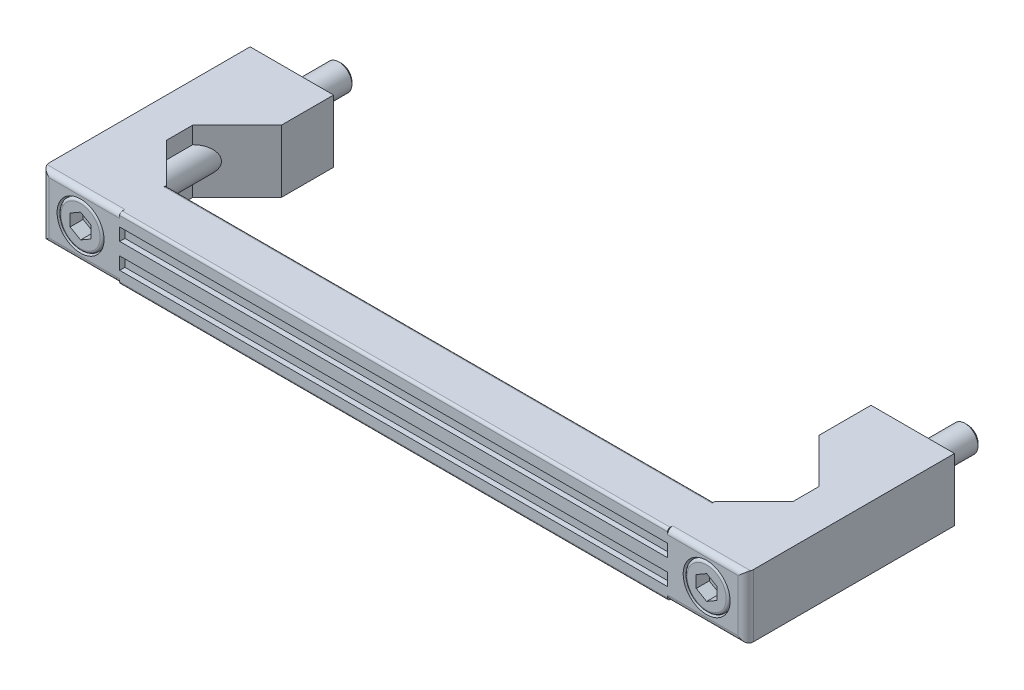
ISO-10303-21;
HEADER;
FILE_DESCRIPTION(('STEP AP214'),'2;1');
FILE_NAME('part.step','',(''),(''),'','','');
FILE_SCHEMA(('AUTOMOTIVE_DESIGN { 1 0 10303 214 1 1 1 1 }'));
ENDSEC;
DATA;
#1=APPLICATION_CONTEXT('core data for automotive mechanical design processes');
#2=APPLICATION_PROTOCOL_DEFINITION('international standard','automotive_design',2000,#1);
#3=PRODUCT_CONTEXT('',#1,'mechanical');
#4=PRODUCT('Part','Part','',(#3));
#5=PRODUCT_RELATED_PRODUCT_CATEGORY('part','',(#4));
#6=PRODUCT_DEFINITION_FORMATION('','',#4);
#7=PRODUCT_DEFINITION_CONTEXT('part definition',#1,'design');
#8=PRODUCT_DEFINITION('design','',#6,#7);
#9=PRODUCT_DEFINITION_SHAPE('','',#8);
#10=(LENGTH_UNIT() NAMED_UNIT(*) SI_UNIT(.MILLI.,.METRE.));
#11=(NAMED_UNIT(*) PLANE_ANGLE_UNIT() SI_UNIT($,.RADIAN.));
#12=(NAMED_UNIT(*) SI_UNIT($,.STERADIAN.) SOLID_ANGLE_UNIT());
#13=UNCERTAINTY_MEASURE_WITH_UNIT(LENGTH_MEASURE(1.E-05),#10,'distance_accuracy_value','');
#14=(GEOMETRIC_REPRESENTATION_CONTEXT(3) GLOBAL_UNCERTAINTY_ASSIGNED_CONTEXT((#13)) GLOBAL_UNIT_ASSIGNED_CONTEXT((#10,
#11,#12)) REPRESENTATION_CONTEXT('',''));
#15=CARTESIAN_POINT('',(0.,0.,0.));
#16=DIRECTION('',(0.,0.,1.));
#17=DIRECTION('',(1.,0.,0.));
#18=AXIS2_PLACEMENT_3D('',#15,#16,#17);
#19=CARTESIAN_POINT('',(112.37,-5.50000000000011,31.5));
#20=DIRECTION('',(-1.,0.,0.));
#21=DIRECTION('',(0.,-1.,0.));
#22=AXIS2_PLACEMENT_3D('',#19,#20,#21);
#23=CYLINDRICAL_SURFACE('',#22,0.5);
#24=DIRECTION('',(-1.,0.,0.));
#25=VECTOR('',#24,1.);
#26=CARTESIAN_POINT('',(112.37,-6.00000000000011,31.5));
#27=LINE('',#26,#25);
#28=CARTESIAN_POINT('',(112.5,-6.00000000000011,31.5));
#29=VERTEX_POINT('',#28);
#30=CARTESIAN_POINT('',(7.5,-6.00000000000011,31.5));
#31=VERTEX_POINT('',#30);
#32=EDGE_CURVE('E481',#29,#31,#27,.T.);
#33=ORIENTED_EDGE('',*,*,#32,.T.);
#34=CARTESIAN_POINT('',(7.5,-5.50000000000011,31.5));
#35=DIRECTION('',(-1.,0.,0.));
#36=DIRECTION('',(0.,0.,1.));
#37=AXIS2_PLACEMENT_3D('',#34,#35,#36);
#38=CIRCLE('',#37,0.5);
#39=CARTESIAN_POINT('',(7.5,-5.50000000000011,31.));
#40=VERTEX_POINT('',#39);
#41=EDGE_CURVE('E543',#40,#31,#38,.T.);
#42=ORIENTED_EDGE('',*,*,#41,.F.);
#43=DIRECTION('',(-1.,0.,0.));
#44=VECTOR('',#43,1.);
#45=CARTESIAN_POINT('',(112.37,-5.50000000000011,31.));
#46=LINE('',#45,#44);
#47=CARTESIAN_POINT('',(112.5,-5.50000000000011,31.));
#48=VERTEX_POINT('',#47);
#49=EDGE_CURVE('E479',#48,#40,#46,.T.);
#50=ORIENTED_EDGE('',*,*,#49,.F.);
#51=CARTESIAN_POINT('',(112.5,-5.50000000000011,31.5));
#52=DIRECTION('',(1.,0.,0.));
#53=DIRECTION('',(0.,0.,-1.));
#54=AXIS2_PLACEMENT_3D('',#51,#52,#53);
#55=CIRCLE('',#54,0.5);
#56=EDGE_CURVE('E545',#29,#48,#55,.T.);
#57=ORIENTED_EDGE('',*,*,#56,.F.);
#58=EDGE_LOOP('',(#33,#42,#50,#57));
#59=FACE_BOUND('',#58,.T.);
#60=ADVANCED_FACE('F14',(#59),#23,.T.);
#61=CARTESIAN_POINT('',(112.37,-5.50000000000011,31.));
#62=DIRECTION('',(0.,0.,1.));
#63=DIRECTION('',(0.,-1.,0.));
#64=AXIS2_PLACEMENT_3D('',#61,#62,#63);
#65=PLANE('',#64);
#66=ORIENTED_EDGE('',*,*,#49,.T.);
#67=DIRECTION('',(0.,-1.,0.));
#68=VECTOR('',#67,1.);
#69=CARTESIAN_POINT('',(7.5,5.49999999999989,31.));
#70=LINE('',#69,#68);
#71=CARTESIAN_POINT('',(7.5,5.49999999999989,31.));
#72=VERTEX_POINT('',#71);
#73=EDGE_CURVE('E371',#72,#40,#70,.T.);
#74=ORIENTED_EDGE('',*,*,#73,.F.);
#75=DIRECTION('',(-1.,0.,0.));
#76=VECTOR('',#75,1.);
#77=CARTESIAN_POINT('',(112.37,5.49999999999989,31.));
#78=LINE('',#77,#76);
#79=CARTESIAN_POINT('',(112.5,5.49999999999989,31.));
#80=VERTEX_POINT('',#79);
#81=EDGE_CURVE('E477',#80,#72,#78,.T.);
#82=ORIENTED_EDGE('',*,*,#81,.F.);
#83=DIRECTION('',(0.,1.,0.));
#84=VECTOR('',#83,1.);
#85=CARTESIAN_POINT('',(112.5,-5.50000000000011,31.));
#86=LINE('',#85,#84);
#87=EDGE_CURVE('E809',#48,#80,#86,.T.);
#88=ORIENTED_EDGE('',*,*,#87,.F.);
#89=EDGE_LOOP('',(#66,#74,#82,#88));
#90=FACE_BOUND('',#89,.T.);
#91=ADVANCED_FACE('F532',(#90),#65,.F.);
#92=CARTESIAN_POINT('',(112.37,5.49999999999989,31.5));
#93=DIRECTION('',(-1.,0.,0.));
#94=DIRECTION('',(0.,-1.,0.));
#95=AXIS2_PLACEMENT_3D('',#92,#93,#94);
#96=CYLINDRICAL_SURFACE('',#95,0.500000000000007);
#97=ORIENTED_EDGE('',*,*,#81,.T.);
#98=CARTESIAN_POINT('',(7.5,5.49999999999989,31.5));
#99=DIRECTION('',(-1.,0.,0.));
#100=DIRECTION('',(0.,0.,1.));
#101=AXIS2_PLACEMENT_3D('',#98,#99,#100);
#102=CIRCLE('',#101,0.5);
#103=CARTESIAN_POINT('',(7.5,5.99999999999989,31.5));
#104=VERTEX_POINT('',#103);
#105=EDGE_CURVE('E570',#104,#72,#102,.T.);
#106=ORIENTED_EDGE('',*,*,#105,.F.);
#107=DIRECTION('',(-1.,0.,0.));
#108=VECTOR('',#107,1.);
#109=CARTESIAN_POINT('',(112.37,5.99999999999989,31.5));
#110=LINE('',#109,#108);
#111=CARTESIAN_POINT('',(112.5,5.99999999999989,31.5));
#112=VERTEX_POINT('',#111);
#113=EDGE_CURVE('E475',#112,#104,#110,.T.);
#114=ORIENTED_EDGE('',*,*,#113,.F.);
#115=CARTESIAN_POINT('',(112.5,5.49999999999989,31.5));
#116=DIRECTION('',(1.,0.,0.));
#117=DIRECTION('',(0.,0.,-1.));
#118=AXIS2_PLACEMENT_3D('',#115,#116,#117);
#119=CIRCLE('',#118,0.5);
#120=EDGE_CURVE('E804',#80,#112,#119,.T.);
#121=ORIENTED_EDGE('',*,*,#120,.F.);
#122=EDGE_LOOP('',(#97,#106,#114,#121));
#123=FACE_BOUND('',#122,.T.);
#124=ADVANCED_FACE('F538',(#123),#96,.T.);
#125=CARTESIAN_POINT('',(112.37,5.99999999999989,31.5));
#126=DIRECTION('',(0.,-1.,0.));
#127=DIRECTION('',(1.,0.,0.));
#128=AXIS2_PLACEMENT_3D('',#125,#126,#127);
#129=PLANE('',#128);
#130=ORIENTED_EDGE('',*,*,#113,.T.);
#131=DIRECTION('',(0.,0.,1.));
#132=VECTOR('',#131,1.);
#133=CARTESIAN_POINT('',(7.5,5.99999999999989,31.));
#134=LINE('',#133,#132);
#135=CARTESIAN_POINT('',(7.5,5.99999999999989,31.));
#136=VERTEX_POINT('',#135);
#137=EDGE_CURVE('E403',#136,#104,#134,.T.);
#138=ORIENTED_EDGE('',*,*,#137,.F.);
#139=DIRECTION('',(0.707106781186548,0.,0.707106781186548));
#140=VECTOR('',#139,1.);
#141=CARTESIAN_POINT('',(0.,5.99999999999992,23.5));
#142=LINE('',#141,#140);
#143=CARTESIAN_POINT('',(0.,5.99999999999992,23.5));
#144=VERTEX_POINT('',#143);
#145=EDGE_CURVE('E431',#144,#136,#142,.T.);
#146=ORIENTED_EDGE('',*,*,#145,.F.);
#147=DIRECTION('',(0.,0.,1.));
#148=VECTOR('',#147,1.);
#149=CARTESIAN_POINT('',(0.,6.,18.5));
#150=LINE('',#149,#148);
#151=CARTESIAN_POINT('',(0.,6.,18.5));
#152=VERTEX_POINT('',#151);
#153=EDGE_CURVE('E428',#152,#144,#150,.T.);
#154=ORIENTED_EDGE('',*,*,#153,.F.);
#155=DIRECTION('',(-0.707106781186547,0.,0.707106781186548));
#156=VECTOR('',#155,1.);
#157=CARTESIAN_POINT('',(8.5,6.,10.));
#158=LINE('',#157,#156);
#159=CARTESIAN_POINT('',(8.5,6.,10.));
#160=VERTEX_POINT('',#159);
#161=EDGE_CURVE('E426',#160,#152,#158,.T.);
#162=ORIENTED_EDGE('',*,*,#161,.F.);
#163=DIRECTION('',(0.,0.,1.));
#164=VECTOR('',#163,1.);
#165=CARTESIAN_POINT('',(8.5,6.,0.));
#166=LINE('',#165,#164);
#167=CARTESIAN_POINT('',(8.5,6.,0.));
#168=VERTEX_POINT('',#167);
#169=EDGE_CURVE('E424',#168,#160,#166,.T.);
#170=ORIENTED_EDGE('',*,*,#169,.F.);
#171=DIRECTION('',(1.,0.,0.));
#172=VECTOR('',#171,1.);
#173=CARTESIAN_POINT('',(-7.5,6.,0.));
#174=LINE('',#173,#172);
#175=CARTESIAN_POINT('',(-7.5,6.,0.));
#176=VERTEX_POINT('',#175);
#177=EDGE_CURVE('E422',#176,#168,#174,.T.);
#178=ORIENTED_EDGE('',*,*,#177,.F.);
#179=DIRECTION('',(0.,0.,-1.));
#180=VECTOR('',#179,1.);
#181=CARTESIAN_POINT('',(-7.5,5.99999999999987,38.5));
#182=LINE('',#181,#180);
#183=CARTESIAN_POINT('',(-7.5,5.99999999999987,38.5));
#184=VERTEX_POINT('',#183);
#185=EDGE_CURVE('E420',#184,#176,#182,.T.);
#186=ORIENTED_EDGE('',*,*,#185,.F.);
#187=CARTESIAN_POINT('',(-6.,5.99999999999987,38.5));
#188=DIRECTION('',(0.,-1.,0.));
#189=DIRECTION('',(1.,0.,0.));
#190=AXIS2_PLACEMENT_3D('',#187,#188,#189);
#191=CIRCLE('',#190,1.5);
#192=CARTESIAN_POINT('',(-7.4142135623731,5.99999999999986,39.));
#193=VERTEX_POINT('',#192);
#194=EDGE_CURVE('E399',#193,#184,#191,.T.);
#195=ORIENTED_EDGE('',*,*,#194,.F.);
#196=DIRECTION('',(1.,0.,0.));
#197=VECTOR('',#196,1.);
#198=CARTESIAN_POINT('',(-12.5,5.99999999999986,39.));
#199=LINE('',#198,#197);
#200=CARTESIAN_POINT('',(7.5,5.99999999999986,39.));
#201=VERTEX_POINT('',#200);
#202=EDGE_CURVE('E501',#193,#201,#199,.T.);
#203=ORIENTED_EDGE('',*,*,#202,.T.);
#204=DIRECTION('',(0.,0.,-1.));
#205=VECTOR('',#204,1.);
#206=CARTESIAN_POINT('',(7.5,5.99999999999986,39.5));
#207=LINE('',#206,#205);
#208=CARTESIAN_POINT('',(7.5,5.99999999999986,39.5));
#209=VERTEX_POINT('',#208);
#210=EDGE_CURVE('E717',#209,#201,#207,.T.);
#211=ORIENTED_EDGE('',*,*,#210,.F.);
#212=DIRECTION('',(-1.,0.,0.));
#213=VECTOR('',#212,1.);
#214=CARTESIAN_POINT('',(112.5,5.99999999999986,39.5));
#215=LINE('',#214,#213);
#216=CARTESIAN_POINT('',(112.5,5.99999999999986,39.5));
#217=VERTEX_POINT('',#216);
#218=EDGE_CURVE('E799',#217,#209,#215,.T.);
#219=ORIENTED_EDGE('',*,*,#218,.F.);
#220=DIRECTION('',(0.,0.,1.));
#221=VECTOR('',#220,1.);
#222=CARTESIAN_POINT('',(112.5,5.99999999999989,31.5));
#223=LINE('',#222,#221);
#224=CARTESIAN_POINT('',(112.5,5.99999999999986,39.));
#225=VERTEX_POINT('',#224);
#226=EDGE_CURVE('E798',#225,#217,#223,.T.);
#227=ORIENTED_EDGE('',*,*,#226,.F.);
#228=DIRECTION('',(-1.,0.,0.));
#229=VECTOR('',#228,1.);
#230=CARTESIAN_POINT('',(132.5,5.99999999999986,39.));
#231=LINE('',#230,#229);
#232=CARTESIAN_POINT('',(127.414213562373,5.99999999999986,39.));
#233=VERTEX_POINT('',#232);
#234=EDGE_CURVE('E496',#225,#233,#231,.F.);
#235=ORIENTED_EDGE('',*,*,#234,.T.);
#236=CARTESIAN_POINT('',(126.,5.99999999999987,38.5));
#237=DIRECTION('',(0.,-1.,0.));
#238=DIRECTION('',(1.,0.,0.));
#239=AXIS2_PLACEMENT_3D('',#236,#237,#238);
#240=CIRCLE('',#239,1.50000000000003);
#241=CARTESIAN_POINT('',(127.5,5.99999999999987,38.5));
#242=VERTEX_POINT('',#241);
#243=EDGE_CURVE('E793',#242,#233,#240,.T.);
#244=ORIENTED_EDGE('',*,*,#243,.F.);
#245=DIRECTION('',(0.,0.,1.));
#246=VECTOR('',#245,1.);
#247=CARTESIAN_POINT('',(127.5,6.,0.));
#248=LINE('',#247,#246);
#249=CARTESIAN_POINT('',(127.5,6.,0.));
#250=VERTEX_POINT('',#249);
#251=EDGE_CURVE('E843',#250,#242,#248,.T.);
#252=ORIENTED_EDGE('',*,*,#251,.F.);
#253=DIRECTION('',(1.,0.,0.));
#254=VECTOR('',#253,1.);
#255=CARTESIAN_POINT('',(111.5,6.,0.));
#256=LINE('',#255,#254);
#257=CARTESIAN_POINT('',(111.5,6.,0.));
#258=VERTEX_POINT('',#257);
#259=EDGE_CURVE('E841',#258,#250,#256,.T.);
#260=ORIENTED_EDGE('',*,*,#259,.F.);
#261=DIRECTION('',(0.,0.,-1.));
#262=VECTOR('',#261,1.);
#263=CARTESIAN_POINT('',(111.5,6.,10.));
#264=LINE('',#263,#262);
#265=CARTESIAN_POINT('',(111.5,6.,10.));
#266=VERTEX_POINT('',#265);
#267=EDGE_CURVE('E838',#266,#258,#264,.T.);
#268=ORIENTED_EDGE('',*,*,#267,.F.);
#269=DIRECTION('',(-0.707106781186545,0.,-0.70710678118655));
#270=VECTOR('',#269,1.);
#271=CARTESIAN_POINT('',(120.,6.,18.5));
#272=LINE('',#271,#270);
#273=CARTESIAN_POINT('',(120.,6.,18.5));
#274=VERTEX_POINT('',#273);
#275=EDGE_CURVE('E836',#274,#266,#272,.T.);
#276=ORIENTED_EDGE('',*,*,#275,.F.);
#277=DIRECTION('',(0.,0.,-1.));
#278=VECTOR('',#277,1.);
#279=CARTESIAN_POINT('',(120.,5.99999999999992,23.5));
#280=LINE('',#279,#278);
#281=CARTESIAN_POINT('',(120.,5.99999999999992,23.5));
#282=VERTEX_POINT('',#281);
#283=EDGE_CURVE('E852',#282,#274,#280,.T.);
#284=ORIENTED_EDGE('',*,*,#283,.F.);
#285=DIRECTION('',(0.707106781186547,0.,-0.707106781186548));
#286=VECTOR('',#285,1.);
#287=CARTESIAN_POINT('',(112.5,5.99999999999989,31.));
#288=LINE('',#287,#286);
#289=CARTESIAN_POINT('',(112.5,5.99999999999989,31.));
#290=VERTEX_POINT('',#289);
#291=EDGE_CURVE('E849',#290,#282,#288,.T.);
#292=ORIENTED_EDGE('',*,*,#291,.F.);
#293=DIRECTION('',(0.,0.,-1.));
#294=VECTOR('',#293,1.);
#295=CARTESIAN_POINT('',(112.5,5.99999999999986,40.));
#296=LINE('',#295,#294);
#297=EDGE_CURVE('E846',#112,#290,#296,.T.);
#298=ORIENTED_EDGE('',*,*,#297,.F.);
#299=EDGE_LOOP('',(#130,#138,#146,#154,#162,#170,#178,#186,#195,#203,#211,#219,#227,#235,#244,
#252,#260,#268,#276,#284,#292,#298));
#300=FACE_BOUND('',#299,.T.);
#301=ADVANCED_FACE('F701',(#300),#129,.F.);
#302=CARTESIAN_POINT('',(112.37,3.59999999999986,40.));
#303=DIRECTION('',(0.,1.,0.));
#304=DIRECTION('',(-1.,0.,0.));
#305=AXIS2_PLACEMENT_3D('',#302,#303,#304);
#306=PLANE('',#305);
#307=DIRECTION('',(-1.,0.,0.));
#308=VECTOR('',#307,1.);
#309=CARTESIAN_POINT('',(112.37,3.59999999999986,40.));
#310=LINE('',#309,#308);
#311=CARTESIAN_POINT('',(112.5,3.59999999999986,40.));
#312=VERTEX_POINT('',#311);
#313=CARTESIAN_POINT('',(7.5,3.59999999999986,40.));
#314=VERTEX_POINT('',#313);
#315=EDGE_CURVE('E473',#312,#314,#310,.T.);
#316=ORIENTED_EDGE('',*,*,#315,.T.);
#317=DIRECTION('',(0.,0.,1.));
#318=VECTOR('',#317,1.);
#319=CARTESIAN_POINT('',(7.5,3.59999999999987,39.));
#320=LINE('',#319,#318);
#321=CARTESIAN_POINT('',(7.5,3.59999999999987,39.));
#322=VERTEX_POINT('',#321);
#323=EDGE_CURVE('E733',#322,#314,#320,.T.);
#324=ORIENTED_EDGE('',*,*,#323,.F.);
#325=DIRECTION('',(-1.,0.,0.));
#326=VECTOR('',#325,1.);
#327=CARTESIAN_POINT('',(112.37,3.59999999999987,39.));
#328=LINE('',#327,#326);
#329=CARTESIAN_POINT('',(112.5,3.59999999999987,39.));
#330=VERTEX_POINT('',#329);
#331=EDGE_CURVE('E471',#330,#322,#328,.T.);
#332=ORIENTED_EDGE('',*,*,#331,.F.);
#333=DIRECTION('',(0.,0.,-1.));
#334=VECTOR('',#333,1.);
#335=CARTESIAN_POINT('',(112.5,3.59999999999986,40.));
#336=LINE('',#335,#334);
#337=EDGE_CURVE('E1541',#312,#330,#336,.T.);
#338=ORIENTED_EDGE('',*,*,#337,.F.);
#339=EDGE_LOOP('',(#316,#324,#332,#338));
#340=FACE_BOUND('',#339,.T.);
#341=ADVANCED_FACE('F1475',(#340),#306,.F.);
#342=CARTESIAN_POINT('',(112.37,3.59999999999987,39.));
#343=DIRECTION('',(0.,0.,-1.));
#344=DIRECTION('',(0.,1.,0.));
#345=AXIS2_PLACEMENT_3D('',#342,#343,#344);
#346=PLANE('',#345);
#347=ORIENTED_EDGE('',*,*,#331,.T.);
#348=DIRECTION('',(0.,1.,0.));
#349=VECTOR('',#348,1.);
#350=CARTESIAN_POINT('',(7.5,1.19999999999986,39.));
#351=LINE('',#350,#349);
#352=CARTESIAN_POINT('',(7.5,1.19999999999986,39.));
#353=VERTEX_POINT('',#352);
#354=EDGE_CURVE('E736',#353,#322,#351,.T.);
#355=ORIENTED_EDGE('',*,*,#354,.F.);
#356=DIRECTION('',(-1.,0.,0.));
#357=VECTOR('',#356,1.);
#358=CARTESIAN_POINT('',(112.37,1.19999999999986,39.));
#359=LINE('',#358,#357);
#360=CARTESIAN_POINT('',(112.5,1.19999999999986,39.));
#361=VERTEX_POINT('',#360);
#362=EDGE_CURVE('E469',#361,#353,#359,.T.);
#363=ORIENTED_EDGE('',*,*,#362,.F.);
#364=DIRECTION('',(0.,-1.,0.));
#365=VECTOR('',#364,1.);
#366=CARTESIAN_POINT('',(112.5,3.59999999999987,39.));
#367=LINE('',#366,#365);
#368=EDGE_CURVE('E1544',#330,#361,#367,.T.);
#369=ORIENTED_EDGE('',*,*,#368,.F.);
#370=EDGE_LOOP('',(#347,#355,#363,#369));
#371=FACE_BOUND('',#370,.T.);
#372=ADVANCED_FACE('F1465',(#371),#346,.F.);
#373=CARTESIAN_POINT('',(112.37,1.19999999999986,39.));
#374=DIRECTION('',(0.,-1.,0.));
#375=DIRECTION('',(0.,0.,-1.));
#376=AXIS2_PLACEMENT_3D('',#373,#374,#375);
#377=PLANE('',#376);
#378=ORIENTED_EDGE('',*,*,#362,.T.);
#379=DIRECTION('',(0.,0.,-1.));
#380=VECTOR('',#379,1.);
#381=CARTESIAN_POINT('',(7.5,1.19999999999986,40.));
#382=LINE('',#381,#380);
#383=CARTESIAN_POINT('',(7.5,1.19999999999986,40.));
#384=VERTEX_POINT('',#383);
#385=EDGE_CURVE('E739',#384,#353,#382,.T.);
#386=ORIENTED_EDGE('',*,*,#385,.F.);
#387=DIRECTION('',(-1.,0.,0.));
#388=VECTOR('',#387,1.);
#389=CARTESIAN_POINT('',(112.37,1.19999999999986,40.));
#390=LINE('',#389,#388);
#391=CARTESIAN_POINT('',(112.5,1.19999999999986,40.));
#392=VERTEX_POINT('',#391);
#393=EDGE_CURVE('E467',#392,#384,#390,.T.);
#394=ORIENTED_EDGE('',*,*,#393,.F.);
#395=DIRECTION('',(0.,0.,1.));
#396=VECTOR('',#395,1.);
#397=CARTESIAN_POINT('',(112.5,1.19999999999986,39.));
#398=LINE('',#397,#396);
#399=EDGE_CURVE('E1547',#361,#392,#398,.T.);
#400=ORIENTED_EDGE('',*,*,#399,.F.);
#401=EDGE_LOOP('',(#378,#386,#394,#400));
#402=FACE_BOUND('',#401,.T.);
#403=ADVANCED_FACE('F1455',(#402),#377,.F.);
#404=CARTESIAN_POINT('',(112.37,-1.20000000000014,40.));
#405=DIRECTION('',(0.,1.,0.));
#406=DIRECTION('',(0.,0.,1.));
#407=AXIS2_PLACEMENT_3D('',#404,#405,#406);
#408=PLANE('',#407);
#409=DIRECTION('',(-1.,0.,0.));
#410=VECTOR('',#409,1.);
#411=CARTESIAN_POINT('',(112.37,-1.20000000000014,40.));
#412=LINE('',#411,#410);
#413=CARTESIAN_POINT('',(112.5,-1.20000000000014,40.));
#414=VERTEX_POINT('',#413);
#415=CARTESIAN_POINT('',(7.5,-1.20000000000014,40.));
#416=VERTEX_POINT('',#415);
#417=EDGE_CURVE('E375',#414,#416,#412,.T.);
#418=ORIENTED_EDGE('',*,*,#417,.T.);
#419=DIRECTION('',(0.,0.,1.));
#420=VECTOR('',#419,1.);
#421=CARTESIAN_POINT('',(7.5,-1.20000000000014,39.));
#422=LINE('',#421,#420);
#423=CARTESIAN_POINT('',(7.5,-1.20000000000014,39.));
#424=VERTEX_POINT('',#423);
#425=EDGE_CURVE('E742',#424,#416,#422,.T.);
#426=ORIENTED_EDGE('',*,*,#425,.F.);
#427=DIRECTION('',(-1.,0.,0.));
#428=VECTOR('',#427,1.);
#429=CARTESIAN_POINT('',(112.37,-1.20000000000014,39.));
#430=LINE('',#429,#428);
#431=CARTESIAN_POINT('',(112.5,-1.20000000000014,39.));
#432=VERTEX_POINT('',#431);
#433=EDGE_CURVE('E36',#432,#424,#430,.T.);
#434=ORIENTED_EDGE('',*,*,#433,.F.);
#435=DIRECTION('',(0.,0.,-1.));
#436=VECTOR('',#435,1.);
#437=CARTESIAN_POINT('',(112.5,-1.20000000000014,40.));
#438=LINE('',#437,#436);
#439=EDGE_CURVE('E1551',#414,#432,#438,.T.);
#440=ORIENTED_EDGE('',*,*,#439,.F.);
#441=EDGE_LOOP('',(#418,#426,#434,#440));
#442=FACE_BOUND('',#441,.T.);
#443=ADVANCED_FACE('F1446',(#442),#408,.F.);
#444=CARTESIAN_POINT('',(112.37,-1.20000000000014,39.));
#445=DIRECTION('',(0.,0.,-1.));
#446=DIRECTION('',(0.,1.,0.));
#447=AXIS2_PLACEMENT_3D('',#444,#445,#446);
#448=PLANE('',#447);
#449=ORIENTED_EDGE('',*,*,#433,.T.);
#450=DIRECTION('',(0.,1.,0.));
#451=VECTOR('',#450,1.);
#452=CARTESIAN_POINT('',(7.5,-3.60000000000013,39.));
#453=LINE('',#452,#451);
#454=CARTESIAN_POINT('',(7.5,-3.60000000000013,39.));
#455=VERTEX_POINT('',#454);
#456=EDGE_CURVE('E745',#455,#424,#453,.T.);
#457=ORIENTED_EDGE('',*,*,#456,.F.);
#458=DIRECTION('',(-1.,0.,0.));
#459=VECTOR('',#458,1.);
#460=CARTESIAN_POINT('',(112.37,-3.60000000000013,39.));
#461=LINE('',#460,#459);
#462=CARTESIAN_POINT('',(112.5,-3.60000000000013,39.));
#463=VERTEX_POINT('',#462);
#464=EDGE_CURVE('E28',#463,#455,#461,.T.);
#465=ORIENTED_EDGE('',*,*,#464,.F.);
#466=DIRECTION('',(0.,-1.,0.));
#467=VECTOR('',#466,1.);
#468=CARTESIAN_POINT('',(112.5,-1.20000000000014,39.));
#469=LINE('',#468,#467);
#470=EDGE_CURVE('E370',#432,#463,#469,.T.);
#471=ORIENTED_EDGE('',*,*,#470,.F.);
#472=EDGE_LOOP('',(#449,#457,#465,#471));
#473=FACE_BOUND('',#472,.T.);
#474=ADVANCED_FACE('F1437',(#473),#448,.F.);
#475=CARTESIAN_POINT('',(112.37,-3.60000000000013,39.));
#476=DIRECTION('',(0.,-1.,0.));
#477=DIRECTION('',(0.,0.,-1.));
#478=AXIS2_PLACEMENT_3D('',#475,#476,#477);
#479=PLANE('',#478);
#480=ORIENTED_EDGE('',*,*,#464,.T.);
#481=DIRECTION('',(0.,0.,-1.));
#482=VECTOR('',#481,1.);
#483=CARTESIAN_POINT('',(7.5,-3.60000000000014,40.));
#484=LINE('',#483,#482);
#485=CARTESIAN_POINT('',(7.5,-3.60000000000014,40.));
#486=VERTEX_POINT('',#485);
#487=EDGE_CURVE('E358',#486,#455,#484,.T.);
#488=ORIENTED_EDGE('',*,*,#487,.F.);
#489=DIRECTION('',(-1.,0.,0.));
#490=VECTOR('',#489,1.);
#491=CARTESIAN_POINT('',(112.37,-3.60000000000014,40.));
#492=LINE('',#491,#490);
#493=CARTESIAN_POINT('',(112.5,-3.60000000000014,40.));
#494=VERTEX_POINT('',#493);
#495=EDGE_CURVE('E353',#494,#486,#492,.T.);
#496=ORIENTED_EDGE('',*,*,#495,.F.);
#497=DIRECTION('',(0.,0.,1.));
#498=VECTOR('',#497,1.);
#499=CARTESIAN_POINT('',(112.5,-3.60000000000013,39.));
#500=LINE('',#499,#498);
#501=EDGE_CURVE('E356',#463,#494,#500,.T.);
#502=ORIENTED_EDGE('',*,*,#501,.F.);
#503=EDGE_LOOP('',(#480,#488,#496,#502));
#504=FACE_BOUND('',#503,.T.);
#505=ADVANCED_FACE('F355',(#504),#479,.F.);
#506=CARTESIAN_POINT('',(112.37,-3.60000000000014,40.));
#507=DIRECTION('',(0.,0.,-1.));
#508=DIRECTION('',(0.,1.,0.));
#509=AXIS2_PLACEMENT_3D('',#506,#507,#508);
#510=PLANE('',#509);
#511=ORIENTED_EDGE('',*,*,#315,.F.);
#512=DIRECTION('',(0.,1.,0.));
#513=VECTOR('',#512,1.);
#514=CARTESIAN_POINT('',(112.5,-6.00000000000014,40.));
#515=LINE('',#514,#513);
#516=EDGE_CURVE('E378',#392,#312,#515,.T.);
#517=ORIENTED_EDGE('',*,*,#516,.F.);
#518=ORIENTED_EDGE('',*,*,#393,.T.);
#519=DIRECTION('',(0.,1.,0.));
#520=VECTOR('',#519,1.);
#521=CARTESIAN_POINT('',(7.5,-6.00000000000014,40.));
#522=LINE('',#521,#520);
#523=EDGE_CURVE('E438',#384,#314,#522,.T.);
#524=ORIENTED_EDGE('',*,*,#523,.T.);
#525=EDGE_LOOP('',(#511,#517,#518,#524));
#526=FACE_BOUND('',#525,.T.);
#527=ORIENTED_EDGE('',*,*,#417,.F.);
#528=EDGE_CURVE('E369',#494,#414,#515,.T.);
#529=ORIENTED_EDGE('',*,*,#528,.F.);
#530=ORIENTED_EDGE('',*,*,#495,.T.);
#531=EDGE_CURVE('E441',#486,#416,#522,.T.);
#532=ORIENTED_EDGE('',*,*,#531,.T.);
#533=EDGE_LOOP('',(#527,#529,#530,#532));
#534=FACE_BOUND('',#533,.T.);
#535=DIRECTION('',(0.,-1.,0.));
#536=VECTOR('',#535,1.);
#537=CARTESIAN_POINT('',(112.5,5.49999999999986,40.));
#538=LINE('',#537,#536);
#539=CARTESIAN_POINT('',(112.5,5.49999999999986,40.));
#540=VERTEX_POINT('',#539);
#541=CARTESIAN_POINT('',(112.5,4.99999999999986,40.));
#542=VERTEX_POINT('',#541);
#543=EDGE_CURVE('E806',#540,#542,#538,.T.);
#544=ORIENTED_EDGE('',*,*,#543,.F.);
#545=DIRECTION('',(-1.,0.,0.));
#546=VECTOR('',#545,1.);
#547=CARTESIAN_POINT('',(112.5,5.49999999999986,40.));
#548=LINE('',#547,#546);
#549=CARTESIAN_POINT('',(7.5,5.49999999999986,40.));
#550=VERTEX_POINT('',#549);
#551=EDGE_CURVE('E769',#540,#550,#548,.T.);
#552=ORIENTED_EDGE('',*,*,#551,.T.);
#553=DIRECTION('',(0.,1.,0.));
#554=VECTOR('',#553,1.);
#555=CARTESIAN_POINT('',(7.5,3.59999999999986,40.));
#556=LINE('',#555,#554);
#557=CARTESIAN_POINT('',(7.5,4.99999999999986,40.));
#558=VERTEX_POINT('',#557);
#559=EDGE_CURVE('E728',#558,#550,#556,.T.);
#560=ORIENTED_EDGE('',*,*,#559,.F.);
#561=DIRECTION('',(1.,0.,0.));
#562=VECTOR('',#561,1.);
#563=CARTESIAN_POINT('',(-12.5,4.99999999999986,40.));
#564=LINE('',#563,#562);
#565=CARTESIAN_POINT('',(-6.,4.99999999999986,40.));
#566=VERTEX_POINT('',#565);
#567=EDGE_CURVE('E573',#566,#558,#564,.T.);
#568=ORIENTED_EDGE('',*,*,#567,.F.);
#569=DIRECTION('',(0.,1.,0.));
#570=VECTOR('',#569,1.);
#571=CARTESIAN_POINT('',(-6.,-6.00000000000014,40.));
#572=LINE('',#571,#570);
#573=CARTESIAN_POINT('',(-6.,-5.00000000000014,40.));
#574=VERTEX_POINT('',#573);
#575=EDGE_CURVE('E418',#574,#566,#572,.T.);
#576=ORIENTED_EDGE('',*,*,#575,.F.);
#577=DIRECTION('',(1.,0.,0.));
#578=VECTOR('',#577,1.);
#579=CARTESIAN_POINT('',(-12.5,-5.00000000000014,40.));
#580=LINE('',#579,#578);
#581=CARTESIAN_POINT('',(7.5,-5.00000000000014,40.));
#582=VERTEX_POINT('',#581);
#583=EDGE_CURVE('E575',#574,#582,#580,.T.);
#584=ORIENTED_EDGE('',*,*,#583,.T.);
#585=DIRECTION('',(0.,1.,0.));
#586=VECTOR('',#585,1.);
#587=CARTESIAN_POINT('',(7.5,-5.50000000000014,40.));
#588=LINE('',#587,#586);
#589=CARTESIAN_POINT('',(7.5,-5.50000000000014,40.));
#590=VERTEX_POINT('',#589);
#591=EDGE_CURVE('E748',#590,#582,#588,.T.);
#592=ORIENTED_EDGE('',*,*,#591,.F.);
#593=DIRECTION('',(-1.,0.,0.));
#594=VECTOR('',#593,1.);
#595=CARTESIAN_POINT('',(112.5,-5.50000000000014,40.));
#596=LINE('',#595,#594);
#597=CARTESIAN_POINT('',(112.5,-5.50000000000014,40.));
#598=VERTEX_POINT('',#597);
#599=EDGE_CURVE('E763',#598,#590,#596,.T.);
#600=ORIENTED_EDGE('',*,*,#599,.F.);
#601=DIRECTION('',(0.,-1.,0.));
#602=VECTOR('',#601,1.);
#603=CARTESIAN_POINT('',(112.5,-3.60000000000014,40.));
#604=LINE('',#603,#602);
#605=CARTESIAN_POINT('',(112.5,-5.00000000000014,40.));
#606=VERTEX_POINT('',#605);
#607=EDGE_CURVE('E788',#606,#598,#604,.T.);
#608=ORIENTED_EDGE('',*,*,#607,.F.);
#609=DIRECTION('',(-1.,0.,0.));
#610=VECTOR('',#609,1.);
#611=CARTESIAN_POINT('',(132.5,-5.00000000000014,40.));
#612=LINE('',#611,#610);
#613=CARTESIAN_POINT('',(126.,-5.00000000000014,40.));
#614=VERTEX_POINT('',#613);
#615=EDGE_CURVE('E628',#614,#606,#612,.T.);
#616=ORIENTED_EDGE('',*,*,#615,.F.);
#617=DIRECTION('',(0.,1.,0.));
#618=VECTOR('',#617,1.);
#619=CARTESIAN_POINT('',(126.,-6.00000000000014,40.));
#620=LINE('',#619,#618);
#621=CARTESIAN_POINT('',(126.,4.99999999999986,40.));
#622=VERTEX_POINT('',#621);
#623=EDGE_CURVE('E377',#614,#622,#620,.T.);
#624=ORIENTED_EDGE('',*,*,#623,.T.);
#625=DIRECTION('',(-1.,0.,0.));
#626=VECTOR('',#625,1.);
#627=CARTESIAN_POINT('',(132.5,4.99999999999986,40.));
#628=LINE('',#627,#626);
#629=EDGE_CURVE('E782',#622,#542,#628,.T.);
#630=ORIENTED_EDGE('',*,*,#629,.T.);
#631=EDGE_LOOP('',(#544,#552,#560,#568,#576,#584,#592,#600,#608,#616,#624,#630));
#632=FACE_BOUND('',#631,.T.);
#633=CARTESIAN_POINT('',(0.,-1.39659253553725E-13,40.));
#634=DIRECTION('',(0.,0.,-1.));
#635=DIRECTION('',(0.,1.,0.));
#636=AXIS2_PLACEMENT_3D('',#633,#634,#635);
#637=CIRCLE('',#636,4.5);
#638=CARTESIAN_POINT('',(0.,4.49999999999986,40.));
#639=VERTEX_POINT('',#638);
#640=EDGE_CURVE('E895',#639,#639,#637,.T.);
#641=ORIENTED_EDGE('',*,*,#640,.T.);
#642=EDGE_LOOP('',(#641));
#643=FACE_BOUND('',#642,.T.);
#644=CARTESIAN_POINT('',(120.,-1.39659253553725E-13,40.));
#645=DIRECTION('',(0.,0.,-1.));
#646=DIRECTION('',(0.,1.,0.));
#647=AXIS2_PLACEMENT_3D('',#644,#645,#646);
#648=CIRCLE('',#647,4.5);
#649=CARTESIAN_POINT('',(120.,4.49999999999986,40.));
#650=VERTEX_POINT('',#649);
#651=EDGE_CURVE('E884',#650,#650,#648,.T.);
#652=ORIENTED_EDGE('',*,*,#651,.T.);
#653=EDGE_LOOP('',(#652));
#654=FACE_BOUND('',#653,.T.);
#655=ADVANCED_FACE('F373',(#526,#534,#632,#643,#654),#510,.F.);
#656=CARTESIAN_POINT('',(112.5,5.49999999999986,39.5));
#657=DIRECTION('',(-1.,0.,0.));
#658=DIRECTION('',(0.,-1.,0.));
#659=AXIS2_PLACEMENT_3D('',#656,#657,#658);
#660=CYLINDRICAL_SURFACE('',#659,0.5);
#661=ORIENTED_EDGE('',*,*,#551,.F.);
#662=CARTESIAN_POINT('',(112.5,5.49999999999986,39.5));
#663=DIRECTION('',(1.,0.,0.));
#664=DIRECTION('',(0.,0.,-1.));
#665=AXIS2_PLACEMENT_3D('',#662,#663,#664);
#666=CIRCLE('',#665,0.5);
#667=EDGE_CURVE('E803',#217,#540,#666,.T.);
#668=ORIENTED_EDGE('',*,*,#667,.F.);
#669=ORIENTED_EDGE('',*,*,#218,.T.);
#670=CARTESIAN_POINT('',(7.5,5.49999999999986,39.5));
#671=DIRECTION('',(-1.,0.,0.));
#672=DIRECTION('',(0.,0.,1.));
#673=AXIS2_PLACEMENT_3D('',#670,#671,#672);
#674=CIRCLE('',#673,0.5);
#675=EDGE_CURVE('E724',#550,#209,#674,.T.);
#676=ORIENTED_EDGE('',*,*,#675,.F.);
#677=EDGE_LOOP('',(#661,#668,#669,#676));
#678=FACE_BOUND('',#677,.T.);
#679=ADVANCED_FACE('F1414',(#678),#660,.T.);
#680=CARTESIAN_POINT('',(112.5,-5.50000000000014,39.5));
#681=DIRECTION('',(-1.,0.,0.));
#682=DIRECTION('',(0.,-1.,0.));
#683=AXIS2_PLACEMENT_3D('',#680,#681,#682);
#684=CYLINDRICAL_SURFACE('',#683,0.499999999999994);
#685=DIRECTION('',(-1.,0.,0.));
#686=VECTOR('',#685,1.);
#687=CARTESIAN_POINT('',(112.5,-6.00000000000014,39.5));
#688=LINE('',#687,#686);
#689=CARTESIAN_POINT('',(112.5,-6.00000000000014,39.5));
#690=VERTEX_POINT('',#689);
#691=CARTESIAN_POINT('',(7.5,-6.00000000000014,39.5));
#692=VERTEX_POINT('',#691);
#693=EDGE_CURVE('E761',#690,#692,#688,.T.);
#694=ORIENTED_EDGE('',*,*,#693,.F.);
#695=CARTESIAN_POINT('',(112.5,-5.50000000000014,39.5));
#696=DIRECTION('',(1.,0.,0.));
#697=DIRECTION('',(0.,0.,-1.));
#698=AXIS2_PLACEMENT_3D('',#695,#696,#697);
#699=CIRCLE('',#698,0.5);
#700=EDGE_CURVE('E766',#598,#690,#699,.T.);
#701=ORIENTED_EDGE('',*,*,#700,.F.);
#702=ORIENTED_EDGE('',*,*,#599,.T.);
#703=CARTESIAN_POINT('',(7.5,-5.50000000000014,39.5));
#704=DIRECTION('',(-1.,0.,0.));
#705=DIRECTION('',(0.,0.,1.));
#706=AXIS2_PLACEMENT_3D('',#703,#704,#705);
#707=CIRCLE('',#706,0.5);
#708=EDGE_CURVE('E751',#692,#590,#707,.T.);
#709=ORIENTED_EDGE('',*,*,#708,.F.);
#710=EDGE_LOOP('',(#694,#701,#702,#709));
#711=FACE_BOUND('',#710,.T.);
#712=ADVANCED_FACE('F759',(#711),#684,.T.);
#713=CARTESIAN_POINT('',(7.5,-6.00000000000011,31.));
#714=DIRECTION('',(-1.,0.,0.));
#715=DIRECTION('',(0.,-1.,0.));
#716=AXIS2_PLACEMENT_3D('',#713,#714,#715);
#717=PLANE('',#716);
#718=ORIENTED_EDGE('',*,*,#210,.T.);
#719=CARTESIAN_POINT('',(7.5,4.99999999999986,39.));
#720=DIRECTION('',(1.,0.,0.));
#721=DIRECTION('',(0.,1.,0.));
#722=AXIS2_PLACEMENT_3D('',#719,#720,#721);
#723=CIRCLE('',#722,1.);
#724=EDGE_CURVE('E569',#201,#558,#723,.T.);
#725=ORIENTED_EDGE('',*,*,#724,.T.);
#726=ORIENTED_EDGE('',*,*,#559,.T.);
#727=ORIENTED_EDGE('',*,*,#675,.T.);
#728=EDGE_LOOP('',(#718,#725,#726,#727));
#729=FACE_BOUND('',#728,.T.);
#730=ADVANCED_FACE('F720',(#729),#717,.T.);
#731=ORIENTED_EDGE('',*,*,#591,.T.);
#732=CARTESIAN_POINT('',(7.5,-5.00000000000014,39.));
#733=DIRECTION('',(1.,0.,0.));
#734=DIRECTION('',(0.,1.,0.));
#735=AXIS2_PLACEMENT_3D('',#732,#733,#734);
#736=CIRCLE('',#735,1.);
#737=CARTESIAN_POINT('',(7.5,-6.00000000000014,39.));
#738=VERTEX_POINT('',#737);
#739=EDGE_CURVE('E566',#582,#738,#736,.T.);
#740=ORIENTED_EDGE('',*,*,#739,.T.);
#741=DIRECTION('',(0.,0.,1.));
#742=VECTOR('',#741,1.);
#743=CARTESIAN_POINT('',(7.5,-6.00000000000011,31.5));
#744=LINE('',#743,#742);
#745=EDGE_CURVE('E552',#738,#692,#744,.T.);
#746=ORIENTED_EDGE('',*,*,#745,.T.);
#747=ORIENTED_EDGE('',*,*,#708,.T.);
#748=EDGE_LOOP('',(#731,#740,#746,#747));
#749=FACE_BOUND('',#748,.T.);
#750=ADVANCED_FACE('F757',(#749),#717,.T.);
#751=CARTESIAN_POINT('',(0.,-1.30930550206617E-13,37.5));
#752=DIRECTION('',(0.,0.,1.));
#753=DIRECTION('',(0.,-1.,0.));
#754=AXIS2_PLACEMENT_3D('',#751,#752,#753);
#755=PLANE('',#754);
#756=DIRECTION('',(0.,-1.,0.));
#757=VECTOR('',#756,1.);
#758=CARTESIAN_POINT('',(-2.,1.15470053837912,37.5));
#759=LINE('',#758,#757);
#760=CARTESIAN_POINT('',(-2.,1.15470053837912,37.5));
#761=VERTEX_POINT('',#760);
#762=CARTESIAN_POINT('',(-2.,-1.15470053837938,37.5));
#763=VERTEX_POINT('',#762);
#764=EDGE_CURVE('E1610',#761,#763,#759,.T.);
#765=ORIENTED_EDGE('',*,*,#764,.T.);
#766=DIRECTION('',(0.866025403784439,-0.5,0.));
#767=VECTOR('',#766,1.);
#768=CARTESIAN_POINT('',(-2.,-1.15470053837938,37.5));
#769=LINE('',#768,#767);
#770=CARTESIAN_POINT('',(0.,-2.30940107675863,37.5));
#771=VERTEX_POINT('',#770);
#772=EDGE_CURVE('E1613',#763,#771,#769,.T.);
#773=ORIENTED_EDGE('',*,*,#772,.T.);
#774=DIRECTION('',(0.866025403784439,0.5,0.));
#775=VECTOR('',#774,1.);
#776=CARTESIAN_POINT('',(0.,-2.30940107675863,37.5));
#777=LINE('',#776,#775);
#778=CARTESIAN_POINT('',(2.,-1.15470053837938,37.5));
#779=VERTEX_POINT('',#778);
#780=EDGE_CURVE('E1617',#771,#779,#777,.T.);
#781=ORIENTED_EDGE('',*,*,#780,.T.);
#782=DIRECTION('',(0.,1.,0.));
#783=VECTOR('',#782,1.);
#784=CARTESIAN_POINT('',(2.,-1.15470053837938,37.5));
#785=LINE('',#784,#783);
#786=CARTESIAN_POINT('',(2.,1.15470053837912,37.5));
#787=VERTEX_POINT('',#786);
#788=EDGE_CURVE('E1620',#779,#787,#785,.T.);
#789=ORIENTED_EDGE('',*,*,#788,.T.);
#790=DIRECTION('',(-0.866025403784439,0.5,0.));
#791=VECTOR('',#790,1.);
#792=CARTESIAN_POINT('',(2.,1.15470053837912,37.5));
#793=LINE('',#792,#791);
#794=CARTESIAN_POINT('',(0.,2.30940107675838,37.5));
#795=VERTEX_POINT('',#794);
#796=EDGE_CURVE('E1623',#787,#795,#793,.T.);
#797=ORIENTED_EDGE('',*,*,#796,.T.);
#798=DIRECTION('',(-0.866025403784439,-0.5,0.));
#799=VECTOR('',#798,1.);
#800=CARTESIAN_POINT('',(0.,2.30940107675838,37.5));
#801=LINE('',#800,#799);
#802=EDGE_CURVE('E1626',#795,#761,#801,.T.);
#803=ORIENTED_EDGE('',*,*,#802,.T.);
#804=EDGE_LOOP('',(#765,#773,#781,#789,#797,#803));
#805=FACE_BOUND('',#804,.T.);
#806=ADVANCED_FACE('F1383',(#805),#755,.T.);
#807=CARTESIAN_POINT('',(2.,-1.15470053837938,37.5));
#808=DIRECTION('',(1.,0.,0.));
#809=DIRECTION('',(0.,1.,0.));
#810=AXIS2_PLACEMENT_3D('',#807,#808,#809);
#811=PLANE('',#810);
#812=DIRECTION('',(0.,0.,1.));
#813=VECTOR('',#812,1.);
#814=CARTESIAN_POINT('',(2.,-1.15470053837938,37.5));
#815=LINE('',#814,#813);
#816=CARTESIAN_POINT('',(2.,-1.15470053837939,40.));
#817=VERTEX_POINT('',#816);
#818=EDGE_CURVE('E1649',#779,#817,#815,.T.);
#819=ORIENTED_EDGE('',*,*,#818,.T.);
#820=DIRECTION('',(0.,-1.,0.));
#821=VECTOR('',#820,1.);
#822=CARTESIAN_POINT('',(2.,-1.39659253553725E-13,40.));
#823=LINE('',#822,#821);
#824=CARTESIAN_POINT('',(2.,1.15470053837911,40.));
#825=VERTEX_POINT('',#824);
#826=EDGE_CURVE('E492',#825,#817,#823,.T.);
#827=ORIENTED_EDGE('',*,*,#826,.F.);
#828=DIRECTION('',(0.,0.,1.));
#829=VECTOR('',#828,1.);
#830=CARTESIAN_POINT('',(2.,1.15470053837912,37.5));
#831=LINE('',#830,#829);
#832=EDGE_CURVE('E1646',#787,#825,#831,.T.);
#833=ORIENTED_EDGE('',*,*,#832,.F.);
#834=ORIENTED_EDGE('',*,*,#788,.F.);
#835=EDGE_LOOP('',(#819,#827,#833,#834));
#836=FACE_BOUND('',#835,.T.);
#837=ADVANCED_FACE('F1374',(#836),#811,.F.);
#838=CARTESIAN_POINT('',(2.,1.15470053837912,37.5));
#839=DIRECTION('',(0.5,0.866025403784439,0.));
#840=DIRECTION('',(-0.866025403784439,0.5,0.));
#841=AXIS2_PLACEMENT_3D('',#838,#839,#840);
#842=PLANE('',#841);
#843=DIRECTION('',(-0.866025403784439,0.5,0.));
#844=VECTOR('',#843,1.);
#845=CARTESIAN_POINT('',(2.,1.15470053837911,40.));
#846=LINE('',#845,#844);
#847=CARTESIAN_POINT('',(0.,2.30940107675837,40.));
#848=VERTEX_POINT('',#847);
#849=EDGE_CURVE('E1638',#825,#848,#846,.T.);
#850=ORIENTED_EDGE('',*,*,#849,.T.);
#851=DIRECTION('',(0.,0.,1.));
#852=VECTOR('',#851,1.);
#853=CARTESIAN_POINT('',(0.,2.30940107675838,37.5));
#854=LINE('',#853,#852);
#855=EDGE_CURVE('E1643',#795,#848,#854,.T.);
#856=ORIENTED_EDGE('',*,*,#855,.F.);
#857=ORIENTED_EDGE('',*,*,#796,.F.);
#858=ORIENTED_EDGE('',*,*,#832,.T.);
#859=EDGE_LOOP('',(#850,#856,#857,#858));
#860=FACE_BOUND('',#859,.T.);
#861=ADVANCED_FACE('F1364',(#860),#842,.F.);
#862=CARTESIAN_POINT('',(0.,2.30940107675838,37.5));
#863=DIRECTION('',(-0.5,0.866025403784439,0.));
#864=DIRECTION('',(-0.866025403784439,-0.5,0.));
#865=AXIS2_PLACEMENT_3D('',#862,#863,#864);
#866=PLANE('',#865);
#867=DIRECTION('',(-0.866025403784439,-0.5,0.));
#868=VECTOR('',#867,1.);
#869=CARTESIAN_POINT('',(0.,2.30940107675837,40.));
#870=LINE('',#869,#868);
#871=CARTESIAN_POINT('',(-2.,1.15470053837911,40.));
#872=VERTEX_POINT('',#871);
#873=EDGE_CURVE('E1614',#848,#872,#870,.T.);
#874=ORIENTED_EDGE('',*,*,#873,.T.);
#875=DIRECTION('',(0.,0.,1.));
#876=VECTOR('',#875,1.);
#877=CARTESIAN_POINT('',(-2.,1.15470053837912,37.5));
#878=LINE('',#877,#876);
#879=EDGE_CURVE('E1629',#761,#872,#878,.T.);
#880=ORIENTED_EDGE('',*,*,#879,.F.);
#881=ORIENTED_EDGE('',*,*,#802,.F.);
#882=ORIENTED_EDGE('',*,*,#855,.T.);
#883=EDGE_LOOP('',(#874,#880,#881,#882));
#884=FACE_BOUND('',#883,.T.);
#885=ADVANCED_FACE('F1355',(#884),#866,.F.);
#886=CARTESIAN_POINT('',(-2.,1.15470053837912,37.5));
#887=DIRECTION('',(-1.,0.,0.));
#888=DIRECTION('',(0.,-1.,0.));
#889=AXIS2_PLACEMENT_3D('',#886,#887,#888);
#890=PLANE('',#889);
#891=DIRECTION('',(0.,-1.,0.));
#892=VECTOR('',#891,1.);
#893=CARTESIAN_POINT('',(-2.,1.15470053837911,40.));
#894=LINE('',#893,#892);
#895=CARTESIAN_POINT('',(-2.,-1.15470053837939,40.));
#896=VERTEX_POINT('',#895);
#897=EDGE_CURVE('E1609',#872,#896,#894,.T.);
#898=ORIENTED_EDGE('',*,*,#897,.T.);
#899=DIRECTION('',(0.,0.,1.));
#900=VECTOR('',#899,1.);
#901=CARTESIAN_POINT('',(-2.,-1.15470053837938,37.5));
#902=LINE('',#901,#900);
#903=EDGE_CURVE('E1654',#763,#896,#902,.T.);
#904=ORIENTED_EDGE('',*,*,#903,.F.);
#905=ORIENTED_EDGE('',*,*,#764,.F.);
#906=ORIENTED_EDGE('',*,*,#879,.T.);
#907=EDGE_LOOP('',(#898,#904,#905,#906));
#908=FACE_BOUND('',#907,.T.);
#909=ADVANCED_FACE('F1346',(#908),#890,.F.);
#910=CARTESIAN_POINT('',(-2.,-1.15470053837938,37.5));
#911=DIRECTION('',(-0.5,-0.866025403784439,0.));
#912=DIRECTION('',(0.866025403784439,-0.5,0.));
#913=AXIS2_PLACEMENT_3D('',#910,#911,#912);
#914=PLANE('',#913);
#915=DIRECTION('',(0.866025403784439,-0.5,0.));
#916=VECTOR('',#915,1.);
#917=CARTESIAN_POINT('',(-2.,-1.15470053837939,40.));
#918=LINE('',#917,#916);
#919=CARTESIAN_POINT('',(0.,-2.30940107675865,40.));
#920=VERTEX_POINT('',#919);
#921=EDGE_CURVE('E1632',#896,#920,#918,.T.);
#922=ORIENTED_EDGE('',*,*,#921,.T.);
#923=DIRECTION('',(0.,0.,1.));
#924=VECTOR('',#923,1.);
#925=CARTESIAN_POINT('',(0.,-2.30940107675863,37.5));
#926=LINE('',#925,#924);
#927=EDGE_CURVE('E1652',#771,#920,#926,.T.);
#928=ORIENTED_EDGE('',*,*,#927,.F.);
#929=ORIENTED_EDGE('',*,*,#772,.F.);
#930=ORIENTED_EDGE('',*,*,#903,.T.);
#931=EDGE_LOOP('',(#922,#928,#929,#930));
#932=FACE_BOUND('',#931,.T.);
#933=ADVANCED_FACE('F1335',(#932),#914,.F.);
#934=CARTESIAN_POINT('',(0.,-2.30940107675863,37.5));
#935=DIRECTION('',(0.5,-0.866025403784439,0.));
#936=DIRECTION('',(0.866025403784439,0.5,0.));
#937=AXIS2_PLACEMENT_3D('',#934,#935,#936);
#938=PLANE('',#937);
#939=DIRECTION('',(0.866025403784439,0.5,0.));
#940=VECTOR('',#939,1.);
#941=CARTESIAN_POINT('',(0.,-2.30940107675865,40.));
#942=LINE('',#941,#940);
#943=EDGE_CURVE('E1635',#920,#817,#942,.T.);
#944=ORIENTED_EDGE('',*,*,#943,.T.);
#945=ORIENTED_EDGE('',*,*,#818,.F.);
#946=ORIENTED_EDGE('',*,*,#780,.F.);
#947=ORIENTED_EDGE('',*,*,#927,.T.);
#948=EDGE_LOOP('',(#944,#945,#946,#947));
#949=FACE_BOUND('',#948,.T.);
#950=ADVANCED_FACE('F1323',(#949),#938,.F.);
#951=CARTESIAN_POINT('',(0.,-1.39659253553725E-13,40.));
#952=DIRECTION('',(0.,0.,-1.));
#953=DIRECTION('',(0.,1.,0.));
#954=AXIS2_PLACEMENT_3D('',#951,#952,#953);
#955=PLANE('',#954);
#956=CARTESIAN_POINT('',(0.,-1.39659253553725E-13,40.));
#957=DIRECTION('',(0.,0.,-1.));
#958=DIRECTION('',(0.,1.,0.));
#959=AXIS2_PLACEMENT_3D('',#956,#957,#958);
#960=CIRCLE('',#959,3.75);
#961=CARTESIAN_POINT('',(0.,3.74999999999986,40.));
#962=VERTEX_POINT('',#961);
#963=EDGE_CURVE('E1683',#962,#962,#960,.T.);
#964=ORIENTED_EDGE('',*,*,#963,.F.);
#965=EDGE_LOOP('',(#964));
#966=FACE_BOUND('',#965,.T.);
#967=ORIENTED_EDGE('',*,*,#943,.F.);
#968=ORIENTED_EDGE('',*,*,#921,.F.);
#969=ORIENTED_EDGE('',*,*,#897,.F.);
#970=ORIENTED_EDGE('',*,*,#873,.F.);
#971=ORIENTED_EDGE('',*,*,#849,.F.);
#972=ORIENTED_EDGE('',*,*,#826,.T.);
#973=EDGE_LOOP('',(#967,#968,#969,#970,#971,#972));
#974=FACE_BOUND('',#973,.T.);
#975=ADVANCED_FACE('F1313',(#966,#974),#955,.F.);
#976=CARTESIAN_POINT('',(0.,-1.37913512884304E-13,39.5));
#977=DIRECTION('',(0.,0.,-1.));
#978=DIRECTION('',(0.,1.,0.));
#979=AXIS2_PLACEMENT_3D('',#976,#977,#978);
#980=TOROIDAL_SURFACE('',#979,3.75,0.5);
#981=ORIENTED_EDGE('',*,*,#963,.T.);
#982=EDGE_LOOP('',(#981));
#983=FACE_BOUND('',#982,.T.);
#984=CARTESIAN_POINT('',(0.,-1.37913512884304E-13,39.5));
#985=DIRECTION('',(0.,0.,-1.));
#986=DIRECTION('',(0.,1.,0.));
#987=AXIS2_PLACEMENT_3D('',#984,#985,#986);
#988=CIRCLE('',#987,4.25);
#989=CARTESIAN_POINT('',(0.,4.24999999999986,39.5));
#990=VERTEX_POINT('',#989);
#991=EDGE_CURVE('E1680',#990,#990,#988,.T.);
#992=ORIENTED_EDGE('',*,*,#991,.F.);
#993=EDGE_LOOP('',(#992));
#994=FACE_BOUND('',#993,.T.);
#995=ADVANCED_FACE('F1304',(#983,#994),#980,.T.);
#996=CARTESIAN_POINT('',(2.0095,0.,-10.));
#997=DIRECTION('',(0.,0.,1.));
#998=DIRECTION('',(0.,-1.,0.));
#999=AXIS2_PLACEMENT_3D('',#996,#997,#998);
#1000=PLANE('',#999);
#1001=CARTESIAN_POINT('',(0.,0.,-10.));
#1002=DIRECTION('',(0.,0.,-1.));
#1003=DIRECTION('',(0.,1.,0.));
#1004=AXIS2_PLACEMENT_3D('',#1001,#1002,#1003);
#1005=CIRCLE('',#1004,2.0095);
#1006=CARTESIAN_POINT('',(0.,2.00950000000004,-9.99999999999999));
#1007=VERTEX_POINT('',#1006);
#1008=EDGE_CURVE('E1671',#1007,#1007,#1005,.T.);
#1009=ORIENTED_EDGE('',*,*,#1008,.T.);
#1010=EDGE_LOOP('',(#1009));
#1011=FACE_BOUND('',#1010,.T.);
#1012=ADVANCED_FACE('F1295',(#1011),#1000,.F.);
#1013=CARTESIAN_POINT('',(0.,0.,-10.));
#1014=DIRECTION('',(0.,0.,-1.));
#1015=DIRECTION('',(0.,1.,0.));
#1016=AXIS2_PLACEMENT_3D('',#1013,#1014,#1015);
#1017=CYLINDRICAL_SURFACE('',#1016,4.25);
#1018=CARTESIAN_POINT('',(0.,-1.2220184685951E-13,35.));
#1019=DIRECTION('',(0.,0.,-1.));
#1020=DIRECTION('',(0.,1.,0.));
#1021=AXIS2_PLACEMENT_3D('',#1018,#1019,#1020);
#1022=CIRCLE('',#1021,4.25);
#1023=CARTESIAN_POINT('',(0.,4.24999999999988,35.));
#1024=VERTEX_POINT('',#1023);
#1025=EDGE_CURVE('E1677',#1024,#1024,#1022,.T.);
#1026=ORIENTED_EDGE('',*,*,#1025,.F.);
#1027=EDGE_LOOP('',(#1026));
#1028=FACE_BOUND('',#1027,.T.);
#1029=ORIENTED_EDGE('',*,*,#991,.T.);
#1030=EDGE_LOOP('',(#1029));
#1031=FACE_BOUND('',#1030,.T.);
#1032=ADVANCED_FACE('F1286',(#1028,#1031),#1017,.T.);
#1033=CARTESIAN_POINT('',(0.,0.,-9.5095));
#1034=DIRECTION('',(0.,0.,1.));
#1035=DIRECTION('',(0.,-1.,0.));
#1036=AXIS2_PLACEMENT_3D('',#1033,#1034,#1035);
#1037=CONICAL_SURFACE('',#1036,2.5,0.785398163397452);
#1038=ORIENTED_EDGE('',*,*,#1008,.F.);
#1039=EDGE_LOOP('',(#1038));
#1040=FACE_BOUND('',#1039,.T.);
#1041=CARTESIAN_POINT('',(0.,0.,-9.5095));
#1042=DIRECTION('',(0.,0.,-1.));
#1043=DIRECTION('',(0.,1.,0.));
#1044=AXIS2_PLACEMENT_3D('',#1041,#1042,#1043);
#1045=CIRCLE('',#1044,2.5);
#1046=CARTESIAN_POINT('',(0.,2.50000000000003,-9.50949999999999));
#1047=VERTEX_POINT('',#1046);
#1048=EDGE_CURVE('E1674',#1047,#1047,#1045,.T.);
#1049=ORIENTED_EDGE('',*,*,#1048,.T.);
#1050=EDGE_LOOP('',(#1049));
#1051=FACE_BOUND('',#1050,.T.);
#1052=ADVANCED_FACE('F1277',(#1040,#1051),#1037,.T.);
#1053=CARTESIAN_POINT('',(4.5,-1.2220184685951E-13,35.));
#1054=DIRECTION('',(0.,0.,1.));
#1055=DIRECTION('',(0.,-1.,0.));
#1056=AXIS2_PLACEMENT_3D('',#1053,#1054,#1055);
#1057=PLANE('',#1056);
#1058=ORIENTED_EDGE('',*,*,#1025,.T.);
#1059=EDGE_LOOP('',(#1058));
#1060=FACE_BOUND('',#1059,.T.);
#1061=CARTESIAN_POINT('',(0.,-1.2220184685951E-13,35.));
#1062=DIRECTION('',(0.,0.,-1.));
#1063=DIRECTION('',(0.,1.,0.));
#1064=AXIS2_PLACEMENT_3D('',#1061,#1062,#1063);
#1065=CIRCLE('',#1064,4.5);
#1066=CARTESIAN_POINT('',(0.,4.49999999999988,35.));
#1067=VERTEX_POINT('',#1066);
#1068=EDGE_CURVE('E886',#1067,#1067,#1065,.T.);
#1069=ORIENTED_EDGE('',*,*,#1068,.F.);
#1070=EDGE_LOOP('',(#1069));
#1071=FACE_BOUND('',#1070,.T.);
#1072=ADVANCED_FACE('F1265',(#1060,#1071),#1057,.T.);
#1073=CARTESIAN_POINT('',(0.,0.,-10.));
#1074=DIRECTION('',(0.,0.,-1.));
#1075=DIRECTION('',(0.,1.,0.));
#1076=AXIS2_PLACEMENT_3D('',#1073,#1074,#1075);
#1077=CYLINDRICAL_SURFACE('',#1076,2.5);
#1078=ORIENTED_EDGE('',*,*,#1048,.F.);
#1079=EDGE_LOOP('',(#1078));
#1080=FACE_BOUND('',#1079,.T.);
#1081=CARTESIAN_POINT('',(0.,0.,0.));
#1082=DIRECTION('',(0.,0.,1.));
#1083=DIRECTION('',(0.,-1.,0.));
#1084=AXIS2_PLACEMENT_3D('',#1081,#1082,#1083);
#1085=CIRCLE('',#1084,2.5);
#1086=CARTESIAN_POINT('',(0.,-2.5,0.));
#1087=VERTEX_POINT('',#1086);
#1088=EDGE_CURVE('E9',#1087,#1087,#1085,.T.);
#1089=ORIENTED_EDGE('',*,*,#1088,.F.);
#1090=EDGE_LOOP('',(#1089));
#1091=FACE_BOUND('',#1090,.T.);
#1092=ADVANCED_FACE('F1255',(#1080,#1091),#1077,.T.);
#1093=CARTESIAN_POINT('',(0.,0.,0.));
#1094=DIRECTION('',(0.,0.,-1.));
#1095=DIRECTION('',(0.,1.,0.));
#1096=AXIS2_PLACEMENT_3D('',#1093,#1094,#1095);
#1097=CYLINDRICAL_SURFACE('',#1096,4.5);
#1098=ORIENTED_EDGE('',*,*,#1068,.T.);
#1099=EDGE_LOOP('',(#1098));
#1100=FACE_BOUND('',#1099,.T.);
#1101=ORIENTED_EDGE('',*,*,#640,.F.);
#1102=EDGE_LOOP('',(#1101));
#1103=FACE_BOUND('',#1102,.T.);
#1104=ADVANCED_FACE('F922',(#1100,#1103),#1097,.F.);
#1105=CARTESIAN_POINT('',(0.,-1.2220184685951E-13,-7.77817459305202));
#1106=DIRECTION('',(0.,0.,1.));
#1107=DIRECTION('',(1.,0.,0.));
#1108=AXIS2_PLACEMENT_3D('',#1105,#1106,#1107);
#1109=CYLINDRICAL_SURFACE('',#1108,2.75);
#1110=CARTESIAN_POINT('',(0.,0.,18.5));
#1111=DIRECTION('',(-0.707106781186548,0.,-0.707106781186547));
#1112=DIRECTION('',(0.707106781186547,0.,-0.707106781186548));
#1113=AXIS2_PLACEMENT_3D('',#1110,#1111,#1112);
#1114=ELLIPSE('',#1113,3.88908729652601,2.75);
#1115=CARTESIAN_POINT('',(0.,-2.75000000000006,18.5));
#1116=VERTEX_POINT('',#1115);
#1117=CARTESIAN_POINT('',(0.,2.74999999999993,18.5));
#1118=VERTEX_POINT('',#1117);
#1119=EDGE_CURVE('E839',#1116,#1118,#1114,.F.);
#1120=ORIENTED_EDGE('',*,*,#1119,.T.);
#1121=DIRECTION('',(0.,0.,-1.));
#1122=VECTOR('',#1121,1.);
#1123=CARTESIAN_POINT('',(0.,2.75,0.));
#1124=LINE('',#1123,#1122);
#1125=CARTESIAN_POINT('',(0.,2.74999999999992,23.5));
#1126=VERTEX_POINT('',#1125);
#1127=EDGE_CURVE('E901',#1118,#1126,#1124,.F.);
#1128=ORIENTED_EDGE('',*,*,#1127,.T.);
#1129=CARTESIAN_POINT('',(0.,0.,23.5));
#1130=DIRECTION('',(-0.707106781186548,0.,0.707106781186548));
#1131=DIRECTION('',(-0.707106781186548,0.,-0.707106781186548));
#1132=AXIS2_PLACEMENT_3D('',#1129,#1130,#1131);
#1133=ELLIPSE('',#1132,3.88908729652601,2.75);
#1134=CARTESIAN_POINT('',(0.,-2.75000000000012,23.5));
#1135=VERTEX_POINT('',#1134);
#1136=EDGE_CURVE('E483',#1126,#1135,#1133,.F.);
#1137=ORIENTED_EDGE('',*,*,#1136,.T.);
#1138=DIRECTION('',(0.,0.,-1.));
#1139=VECTOR('',#1138,1.);
#1140=CARTESIAN_POINT('',(0.,-2.75,0.));
#1141=LINE('',#1140,#1139);
#1142=EDGE_CURVE('E898',#1135,#1116,#1141,.T.);
#1143=ORIENTED_EDGE('',*,*,#1142,.T.);
#1144=EDGE_LOOP('',(#1120,#1128,#1137,#1143));
#1145=FACE_BOUND('',#1144,.T.);
#1146=ADVANCED_FACE('F1238',(#1145),#1109,.T.);
#1147=CARTESIAN_POINT('',(0.,-6.,18.5));
#1148=DIRECTION('',(-1.,0.,0.));
#1149=DIRECTION('',(0.,-1.,0.));
#1150=AXIS2_PLACEMENT_3D('',#1147,#1148,#1149);
#1151=PLANE('',#1150);
#1152=ORIENTED_EDGE('',*,*,#1142,.F.);
#1153=DIRECTION('',(0.,1.,0.));
#1154=VECTOR('',#1153,1.);
#1155=CARTESIAN_POINT('',(0.,-6.00000000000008,23.5));
#1156=LINE('',#1155,#1154);
#1157=CARTESIAN_POINT('',(0.,-6.00000000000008,23.5));
#1158=VERTEX_POINT('',#1157);
#1159=EDGE_CURVE('E447',#1158,#1135,#1156,.T.);
#1160=ORIENTED_EDGE('',*,*,#1159,.F.);
#1161=DIRECTION('',(0.,0.,1.));
#1162=VECTOR('',#1161,1.);
#1163=CARTESIAN_POINT('',(0.,-6.,18.5));
#1164=LINE('',#1163,#1162);
#1165=CARTESIAN_POINT('',(0.,-6.,18.5));
#1166=VERTEX_POINT('',#1165);
#1167=EDGE_CURVE('E411',#1166,#1158,#1164,.T.);
#1168=ORIENTED_EDGE('',*,*,#1167,.F.);
#1169=DIRECTION('',(0.,1.,0.));
#1170=VECTOR('',#1169,1.);
#1171=CARTESIAN_POINT('',(0.,-6.,18.5));
#1172=LINE('',#1171,#1170);
#1173=EDGE_CURVE('E450',#1166,#1116,#1172,.T.);
#1174=ORIENTED_EDGE('',*,*,#1173,.T.);
#1175=EDGE_LOOP('',(#1152,#1160,#1168,#1174));
#1176=FACE_BOUND('',#1175,.T.);
#1177=ADVANCED_FACE('F674',(#1176),#1151,.F.);
#1178=CARTESIAN_POINT('',(8.5,-6.,10.));
#1179=DIRECTION('',(-0.707106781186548,0.,-0.707106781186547));
#1180=DIRECTION('',(0.707106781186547,0.,-0.707106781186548));
#1181=AXIS2_PLACEMENT_3D('',#1178,#1179,#1180);
#1182=PLANE('',#1181);
#1183=ORIENTED_EDGE('',*,*,#1119,.F.);
#1184=ORIENTED_EDGE('',*,*,#1173,.F.);
#1185=DIRECTION('',(-0.707106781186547,0.,0.707106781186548));
#1186=VECTOR('',#1185,1.);
#1187=CARTESIAN_POINT('',(8.5,-6.,10.));
#1188=LINE('',#1187,#1186);
#1189=CARTESIAN_POINT('',(8.5,-6.,10.));
#1190=VERTEX_POINT('',#1189);
#1191=EDGE_CURVE('E409',#1190,#1166,#1188,.T.);
#1192=ORIENTED_EDGE('',*,*,#1191,.F.);
#1193=DIRECTION('',(0.,1.,0.));
#1194=VECTOR('',#1193,1.);
#1195=CARTESIAN_POINT('',(8.5,-6.,10.));
#1196=LINE('',#1195,#1194);
#1197=EDGE_CURVE('E453',#1190,#160,#1196,.T.);
#1198=ORIENTED_EDGE('',*,*,#1197,.T.);
#1199=ORIENTED_EDGE('',*,*,#161,.T.);
#1200=EDGE_CURVE('E449',#1118,#152,#1172,.T.);
#1201=ORIENTED_EDGE('',*,*,#1200,.F.);
#1202=EDGE_LOOP('',(#1183,#1184,#1192,#1198,#1199,#1201));
#1203=FACE_BOUND('',#1202,.T.);
#1204=ADVANCED_FACE('F672',(#1203),#1182,.F.);
#1205=ORIENTED_EDGE('',*,*,#1127,.F.);
#1206=ORIENTED_EDGE('',*,*,#1200,.T.);
#1207=ORIENTED_EDGE('',*,*,#153,.T.);
#1208=EDGE_CURVE('E445',#1126,#144,#1156,.T.);
#1209=ORIENTED_EDGE('',*,*,#1208,.F.);
#1210=EDGE_LOOP('',(#1205,#1206,#1207,#1209));
#1211=FACE_BOUND('',#1210,.T.);
#1212=ADVANCED_FACE('F668',(#1211),#1151,.F.);
#1213=CARTESIAN_POINT('',(-7.5,-6.00000000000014,38.5));
#1214=DIRECTION('',(1.,0.,0.));
#1215=DIRECTION('',(0.,1.,0.));
#1216=AXIS2_PLACEMENT_3D('',#1213,#1214,#1215);
#1217=PLANE('',#1216);
#1218=ORIENTED_EDGE('',*,*,#185,.T.);
#1219=DIRECTION('',(0.,1.,0.));
#1220=VECTOR('',#1219,1.);
#1221=CARTESIAN_POINT('',(-7.5,-6.,0.));
#1222=LINE('',#1221,#1220);
#1223=CARTESIAN_POINT('',(-7.5,-6.,0.));
#1224=VERTEX_POINT('',#1223);
#1225=EDGE_CURVE('E459',#1224,#176,#1222,.T.);
#1226=ORIENTED_EDGE('',*,*,#1225,.F.);
#1227=DIRECTION('',(0.,0.,-1.));
#1228=VECTOR('',#1227,1.);
#1229=CARTESIAN_POINT('',(-7.5,-6.00000000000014,38.5));
#1230=LINE('',#1229,#1228);
#1231=CARTESIAN_POINT('',(-7.5,-6.00000000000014,38.5));
#1232=VERTEX_POINT('',#1231);
#1233=EDGE_CURVE('E402',#1232,#1224,#1230,.T.);
#1234=ORIENTED_EDGE('',*,*,#1233,.F.);
#1235=DIRECTION('',(0.,1.,0.));
#1236=VECTOR('',#1235,1.);
#1237=CARTESIAN_POINT('',(-7.5,-6.00000000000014,38.5));
#1238=LINE('',#1237,#1236);
#1239=EDGE_CURVE('E363',#1232,#184,#1238,.T.);
#1240=ORIENTED_EDGE('',*,*,#1239,.T.);
#1241=EDGE_LOOP('',(#1218,#1226,#1234,#1240));
#1242=FACE_BOUND('',#1241,.T.);
#1243=ADVANCED_FACE('F671',(#1242),#1217,.F.);
#1244=CARTESIAN_POINT('',(-7.5,-6.,0.));
#1245=DIRECTION('',(0.,0.,1.));
#1246=DIRECTION('',(0.,-1.,0.));
#1247=AXIS2_PLACEMENT_3D('',#1244,#1245,#1246);
#1248=PLANE('',#1247);
#1249=ORIENTED_EDGE('',*,*,#177,.T.);
#1250=DIRECTION('',(0.,1.,0.));
#1251=VECTOR('',#1250,1.);
#1252=CARTESIAN_POINT('',(8.5,-6.,0.));
#1253=LINE('',#1252,#1251);
#1254=CARTESIAN_POINT('',(8.5,-6.,0.));
#1255=VERTEX_POINT('',#1254);
#1256=EDGE_CURVE('E456',#1255,#168,#1253,.T.);
#1257=ORIENTED_EDGE('',*,*,#1256,.F.);
#1258=DIRECTION('',(1.,0.,0.));
#1259=VECTOR('',#1258,1.);
#1260=CARTESIAN_POINT('',(-7.5,-6.,0.));
#1261=LINE('',#1260,#1259);
#1262=EDGE_CURVE('E405',#1224,#1255,#1261,.T.);
#1263=ORIENTED_EDGE('',*,*,#1262,.F.);
#1264=ORIENTED_EDGE('',*,*,#1225,.T.);
#1265=EDGE_LOOP('',(#1249,#1257,#1263,#1264));
#1266=FACE_BOUND('',#1265,.T.);
#1267=ORIENTED_EDGE('',*,*,#1088,.T.);
#1268=EDGE_LOOP('',(#1267));
#1269=FACE_BOUND('',#1268,.T.);
#1270=ADVANCED_FACE('F681',(#1266,#1269),#1248,.F.);
#1271=CARTESIAN_POINT('',(8.5,-6.,0.));
#1272=DIRECTION('',(-1.,0.,0.));
#1273=DIRECTION('',(0.,-1.,0.));
#1274=AXIS2_PLACEMENT_3D('',#1271,#1272,#1273);
#1275=PLANE('',#1274);
#1276=ORIENTED_EDGE('',*,*,#169,.T.);
#1277=ORIENTED_EDGE('',*,*,#1197,.F.);
#1278=DIRECTION('',(0.,0.,1.));
#1279=VECTOR('',#1278,1.);
#1280=CARTESIAN_POINT('',(8.5,-6.,0.));
#1281=LINE('',#1280,#1279);
#1282=EDGE_CURVE('E407',#1255,#1190,#1281,.T.);
#1283=ORIENTED_EDGE('',*,*,#1282,.F.);
#1284=ORIENTED_EDGE('',*,*,#1256,.T.);
#1285=EDGE_LOOP('',(#1276,#1277,#1283,#1284));
#1286=FACE_BOUND('',#1285,.T.);
#1287=ADVANCED_FACE('F678',(#1286),#1275,.F.);
#1288=CARTESIAN_POINT('',(-6.,-6.00000000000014,38.5));
#1289=DIRECTION('',(0.,1.,0.));
#1290=DIRECTION('',(-1.,0.,0.));
#1291=AXIS2_PLACEMENT_3D('',#1288,#1289,#1290);
#1292=CYLINDRICAL_SURFACE('',#1291,1.5);
#1293=CARTESIAN_POINT('',(-7.4142135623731,-6.00000000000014,39.));
#1294=CARTESIAN_POINT('',(-7.40424956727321,-6.00000245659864,39.0281970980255));
#1295=CARTESIAN_POINT('',(-7.39344149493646,-5.99880738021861,39.0560680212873));
#1296=CARTESIAN_POINT('',(-7.37027553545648,-5.99420892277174,39.1109230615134));
#1297=CARTESIAN_POINT('',(-7.3579200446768,-5.99080892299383,39.1379084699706));
#1298=CARTESIAN_POINT('',(-7.31896972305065,-5.9776694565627,39.2167468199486));
#1299=CARTESIAN_POINT('',(-7.29027233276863,-5.96498221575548,39.2670931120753));
#1300=CARTESIAN_POINT('',(-7.22135361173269,-5.92965091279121,39.3736101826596));
#1301=CARTESIAN_POINT('',(-7.17999669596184,-5.90539604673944,39.428490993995));
#1302=CARTESIAN_POINT('',(-7.09224414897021,-5.84979362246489,39.5303152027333));
#1303=CARTESIAN_POINT('',(-7.04582667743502,-5.8184146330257,39.5772217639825));
#1304=CARTESIAN_POINT('',(-6.93084106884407,-5.73746395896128,39.6796364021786));
#1305=CARTESIAN_POINT('',(-6.8606492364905,-5.68554984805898,39.7314547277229));
#1306=CARTESIAN_POINT('',(-6.71611701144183,-5.57564976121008,39.8207616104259));
#1307=CARTESIAN_POINT('',(-6.64177100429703,-5.51765547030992,39.8582302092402));
#1308=CARTESIAN_POINT('',(-6.47501328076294,-5.38566383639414,39.9262046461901));
#1309=CARTESIAN_POINT('',(-6.38203741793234,-5.31083244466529,39.9536817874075));
#1310=CARTESIAN_POINT('',(-6.19466507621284,-5.15893375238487,39.9903654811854));
#1311=CARTESIAN_POINT('',(-6.10027209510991,-5.08187162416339,39.9996113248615));
#1312=CARTESIAN_POINT('',(-6.00399994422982,-5.00326594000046,39.9999959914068));
#1313=CARTESIAN_POINT('',(-6.00199994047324,-5.00163294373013,39.999999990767));
#1314=CARTESIAN_POINT('',(-6.,-5.00000000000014,40.));
#1315=B_SPLINE_CURVE_WITH_KNOTS('',3,(#1293,#1294,#1295,#1296,#1297,#1298,#1299,#1300,#1301,
#1302,#1303,#1304,#1305,#1306,#1307,#1308,#1309,#1310,#1311,#1312,#1313,#1314),.UNSPECIFIED.,
.F.,.F.,(4,2,2,2,2,2,2,2,2,2,4),(0.,0.0896361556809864,0.179135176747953,0.356215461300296,
0.573677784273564,0.79211885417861,1.09504447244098,1.39838989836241,1.76428338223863,
2.12938744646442,2.13713342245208),.UNSPECIFIED.);
#1316=CARTESIAN_POINT('',(-7.4142135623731,-6.00000000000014,39.));
#1317=VERTEX_POINT('',#1316);
#1318=EDGE_CURVE('E586',#574,#1317,#1315,.F.);
#1319=ORIENTED_EDGE('',*,*,#1318,.F.);
#1320=ORIENTED_EDGE('',*,*,#575,.T.);
#1321=CARTESIAN_POINT('',(-7.4142135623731,5.99999999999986,39.));
#1322=CARTESIAN_POINT('',(-7.40424956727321,6.00000245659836,39.0281970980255));
#1323=CARTESIAN_POINT('',(-7.39344149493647,5.99880738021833,39.0560680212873));
#1324=CARTESIAN_POINT('',(-7.37027553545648,5.99420892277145,39.1109230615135));
#1325=CARTESIAN_POINT('',(-7.3579200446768,5.99080892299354,39.1379084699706));
#1326=CARTESIAN_POINT('',(-7.31896972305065,5.97766945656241,39.2167468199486));
#1327=CARTESIAN_POINT('',(-7.29027233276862,5.96498221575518,39.2670931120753));
#1328=CARTESIAN_POINT('',(-7.22135361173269,5.92965091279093,39.3736101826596));
#1329=CARTESIAN_POINT('',(-7.17999669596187,5.90539604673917,39.428490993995));
#1330=CARTESIAN_POINT('',(-7.09224414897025,5.84979362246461,39.5303152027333));
#1331=CARTESIAN_POINT('',(-7.04582667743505,5.81841463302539,39.5772217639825));
#1332=CARTESIAN_POINT('',(-6.93084106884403,5.73746395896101,39.6796364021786));
#1333=CARTESIAN_POINT('',(-6.86064923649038,5.68554984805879,39.731454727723));
#1334=CARTESIAN_POINT('',(-6.71611701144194,5.57564976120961,39.820761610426));
#1335=CARTESIAN_POINT('',(-6.64177100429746,5.51765547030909,39.8582302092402));
#1336=CARTESIAN_POINT('',(-6.47501328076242,5.38566383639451,39.9262046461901));
#1337=CARTESIAN_POINT('',(-6.38203741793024,5.31083244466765,39.9536817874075));
#1338=CARTESIAN_POINT('',(-6.19466507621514,5.15893375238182,39.9903654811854));
#1339=CARTESIAN_POINT('',(-6.1002720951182,5.08187162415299,39.9996113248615));
#1340=CARTESIAN_POINT('',(-6.00399994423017,5.00326593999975,39.9999959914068));
#1341=CARTESIAN_POINT('',(-6.00199994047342,5.00163294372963,39.999999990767));
#1342=CARTESIAN_POINT('',(-6.,4.99999999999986,40.));
#1343=B_SPLINE_CURVE_WITH_KNOTS('',3,(#1321,#1322,#1323,#1324,#1325,#1326,#1327,#1328,#1329,
#1330,#1331,#1332,#1333,#1334,#1335,#1336,#1337,#1338,#1339,#1340,#1341,#1342),.UNSPECIFIED.,
.F.,.F.,(4,2,2,2,2,2,2,2,2,2,4),(0.,0.0896361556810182,0.179135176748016,0.356215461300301,
0.573677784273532,0.792118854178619,1.09504447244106,1.39838989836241,1.7642833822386,
2.12938744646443,2.13713342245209),.UNSPECIFIED.);
#1344=EDGE_CURVE('E578',#193,#566,#1343,.T.);
#1345=ORIENTED_EDGE('',*,*,#1344,.F.);
#1346=ORIENTED_EDGE('',*,*,#194,.T.);
#1347=ORIENTED_EDGE('',*,*,#1239,.F.);
#1348=CARTESIAN_POINT('',(-6.,-6.00000000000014,38.5));
#1349=DIRECTION('',(0.,-1.,0.));
#1350=DIRECTION('',(1.,0.,0.));
#1351=AXIS2_PLACEMENT_3D('',#1348,#1349,#1350);
#1352=CIRCLE('',#1351,1.5);
#1353=EDGE_CURVE('E400',#1317,#1232,#1352,.T.);
#1354=ORIENTED_EDGE('',*,*,#1353,.F.);
#1355=EDGE_LOOP('',(#1319,#1320,#1345,#1346,#1347,#1354));
#1356=FACE_BOUND('',#1355,.T.);
#1357=ADVANCED_FACE('F593',(#1356),#1292,.T.);
#1358=CARTESIAN_POINT('',(-12.5,-5.00000000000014,39.));
#1359=DIRECTION('',(1.,0.,0.));
#1360=DIRECTION('',(0.,1.,0.));
#1361=AXIS2_PLACEMENT_3D('',#1358,#1359,#1360);
#1362=CYLINDRICAL_SURFACE('',#1361,1.);
#1363=ORIENTED_EDGE('',*,*,#1318,.T.);
#1364=DIRECTION('',(1.,0.,0.));
#1365=VECTOR('',#1364,1.);
#1366=CARTESIAN_POINT('',(-12.5,-6.00000000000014,39.));
#1367=LINE('',#1366,#1365);
#1368=EDGE_CURVE('E504',#1317,#738,#1367,.T.);
#1369=ORIENTED_EDGE('',*,*,#1368,.T.);
#1370=ORIENTED_EDGE('',*,*,#739,.F.);
#1371=ORIENTED_EDGE('',*,*,#583,.F.);
#1372=EDGE_LOOP('',(#1363,#1369,#1370,#1371));
#1373=FACE_BOUND('',#1372,.T.);
#1374=ADVANCED_FACE('F603',(#1373),#1362,.T.);
#1375=CARTESIAN_POINT('',(-6.,-6.00000000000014,38.5));
#1376=DIRECTION('',(0.,-1.,0.));
#1377=DIRECTION('',(1.,0.,0.));
#1378=AXIS2_PLACEMENT_3D('',#1375,#1376,#1377);
#1379=PLANE('',#1378);
#1380=ORIENTED_EDGE('',*,*,#1191,.T.);
#1381=ORIENTED_EDGE('',*,*,#1167,.T.);
#1382=DIRECTION('',(0.707106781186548,0.,0.707106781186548));
#1383=VECTOR('',#1382,1.);
#1384=CARTESIAN_POINT('',(0.,-6.00000000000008,23.5));
#1385=LINE('',#1384,#1383);
#1386=CARTESIAN_POINT('',(7.5,-6.00000000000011,31.));
#1387=VERTEX_POINT('',#1386);
#1388=EDGE_CURVE('E413',#1158,#1387,#1385,.T.);
#1389=ORIENTED_EDGE('',*,*,#1388,.T.);
#1390=DIRECTION('',(0.,0.,1.));
#1391=VECTOR('',#1390,1.);
#1392=CARTESIAN_POINT('',(7.5,-6.00000000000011,31.));
#1393=LINE('',#1392,#1391);
#1394=EDGE_CURVE('E415',#1387,#31,#1393,.T.);
#1395=ORIENTED_EDGE('',*,*,#1394,.T.);
#1396=ORIENTED_EDGE('',*,*,#32,.F.);
#1397=DIRECTION('',(0.,0.,-1.));
#1398=VECTOR('',#1397,1.);
#1399=CARTESIAN_POINT('',(112.5,-6.00000000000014,40.));
#1400=LINE('',#1399,#1398);
#1401=CARTESIAN_POINT('',(112.5,-6.00000000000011,31.));
#1402=VERTEX_POINT('',#1401);
#1403=EDGE_CURVE('E824',#29,#1402,#1400,.T.);
#1404=ORIENTED_EDGE('',*,*,#1403,.T.);
#1405=DIRECTION('',(0.707106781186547,0.,-0.707106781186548));
#1406=VECTOR('',#1405,1.);
#1407=CARTESIAN_POINT('',(112.5,-6.00000000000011,31.));
#1408=LINE('',#1407,#1406);
#1409=CARTESIAN_POINT('',(120.,-6.00000000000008,23.5));
#1410=VERTEX_POINT('',#1409);
#1411=EDGE_CURVE('E826',#1402,#1410,#1408,.T.);
#1412=ORIENTED_EDGE('',*,*,#1411,.T.);
#1413=DIRECTION('',(0.,0.,-1.));
#1414=VECTOR('',#1413,1.);
#1415=CARTESIAN_POINT('',(120.,-6.00000000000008,23.5));
#1416=LINE('',#1415,#1414);
#1417=CARTESIAN_POINT('',(120.,-6.,18.5));
#1418=VERTEX_POINT('',#1417);
#1419=EDGE_CURVE('E833',#1410,#1418,#1416,.T.);
#1420=ORIENTED_EDGE('',*,*,#1419,.T.);
#1421=DIRECTION('',(-0.707106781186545,0.,-0.70710678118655));
#1422=VECTOR('',#1421,1.);
#1423=CARTESIAN_POINT('',(120.,-6.,18.5));
#1424=LINE('',#1423,#1422);
#1425=CARTESIAN_POINT('',(111.5,-6.,10.));
#1426=VERTEX_POINT('',#1425);
#1427=EDGE_CURVE('E855',#1418,#1426,#1424,.T.);
#1428=ORIENTED_EDGE('',*,*,#1427,.T.);
#1429=DIRECTION('',(0.,0.,-1.));
#1430=VECTOR('',#1429,1.);
#1431=CARTESIAN_POINT('',(111.5,-6.,10.));
#1432=LINE('',#1431,#1430);
#1433=CARTESIAN_POINT('',(111.5,-6.,0.));
#1434=VERTEX_POINT('',#1433);
#1435=EDGE_CURVE('E907',#1426,#1434,#1432,.T.);
#1436=ORIENTED_EDGE('',*,*,#1435,.T.);
#1437=DIRECTION('',(1.,0.,0.));
#1438=VECTOR('',#1437,1.);
#1439=CARTESIAN_POINT('',(111.5,-6.,0.));
#1440=LINE('',#1439,#1438);
#1441=CARTESIAN_POINT('',(127.5,-6.,0.));
#1442=VERTEX_POINT('',#1441);
#1443=EDGE_CURVE('E828',#1434,#1442,#1440,.T.);
#1444=ORIENTED_EDGE('',*,*,#1443,.T.);
#1445=DIRECTION('',(0.,0.,1.));
#1446=VECTOR('',#1445,1.);
#1447=CARTESIAN_POINT('',(127.5,-6.,0.));
#1448=LINE('',#1447,#1446);
#1449=CARTESIAN_POINT('',(127.5,-6.00000000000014,38.5));
#1450=VERTEX_POINT('',#1449);
#1451=EDGE_CURVE('E822',#1442,#1450,#1448,.T.);
#1452=ORIENTED_EDGE('',*,*,#1451,.T.);
#1453=CARTESIAN_POINT('',(126.,-6.00000000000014,38.5));
#1454=DIRECTION('',(0.,-1.,0.));
#1455=DIRECTION('',(1.,0.,0.));
#1456=AXIS2_PLACEMENT_3D('',#1453,#1454,#1455);
#1457=CIRCLE('',#1456,1.50000000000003);
#1458=CARTESIAN_POINT('',(127.414213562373,-6.00000000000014,39.));
#1459=VERTEX_POINT('',#1458);
#1460=EDGE_CURVE('E820',#1450,#1459,#1457,.T.);
#1461=ORIENTED_EDGE('',*,*,#1460,.T.);
#1462=DIRECTION('',(-1.,0.,0.));
#1463=VECTOR('',#1462,1.);
#1464=CARTESIAN_POINT('',(132.5,-6.00000000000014,39.));
#1465=LINE('',#1464,#1463);
#1466=CARTESIAN_POINT('',(112.5,-6.00000000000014,39.));
#1467=VERTEX_POINT('',#1466);
#1468=EDGE_CURVE('E499',#1467,#1459,#1465,.F.);
#1469=ORIENTED_EDGE('',*,*,#1468,.F.);
#1470=DIRECTION('',(0.,0.,-1.));
#1471=VECTOR('',#1470,1.);
#1472=CARTESIAN_POINT('',(112.5,-6.00000000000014,39.5));
#1473=LINE('',#1472,#1471);
#1474=EDGE_CURVE('E816',#690,#1467,#1473,.T.);
#1475=ORIENTED_EDGE('',*,*,#1474,.F.);
#1476=ORIENTED_EDGE('',*,*,#693,.T.);
#1477=ORIENTED_EDGE('',*,*,#745,.F.);
#1478=ORIENTED_EDGE('',*,*,#1368,.F.);
#1479=ORIENTED_EDGE('',*,*,#1353,.T.);
#1480=ORIENTED_EDGE('',*,*,#1233,.T.);
#1481=ORIENTED_EDGE('',*,*,#1262,.T.);
#1482=ORIENTED_EDGE('',*,*,#1282,.T.);
#1483=EDGE_LOOP('',(#1380,#1381,#1389,#1395,#1396,#1404,#1412,#1420,#1428,#1436,#1444,#1452,
#1461,#1469,#1475,#1476,#1477,#1478,#1479,#1480,#1481,#1482));
#1484=FACE_BOUND('',#1483,.T.);
#1485=ADVANCED_FACE('F554',(#1484),#1379,.T.);
#1486=CARTESIAN_POINT('',(-12.5,4.99999999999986,39.));
#1487=DIRECTION('',(1.,0.,0.));
#1488=DIRECTION('',(0.,1.,0.));
#1489=AXIS2_PLACEMENT_3D('',#1486,#1487,#1488);
#1490=CYLINDRICAL_SURFACE('',#1489,1.);
#1491=ORIENTED_EDGE('',*,*,#1344,.T.);
#1492=ORIENTED_EDGE('',*,*,#567,.T.);
#1493=ORIENTED_EDGE('',*,*,#724,.F.);
#1494=ORIENTED_EDGE('',*,*,#202,.F.);
#1495=EDGE_LOOP('',(#1491,#1492,#1493,#1494));
#1496=FACE_BOUND('',#1495,.T.);
#1497=ADVANCED_FACE('F597',(#1496),#1490,.T.);
#1498=CARTESIAN_POINT('',(0.,-6.00000000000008,23.5));
#1499=DIRECTION('',(-0.707106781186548,0.,0.707106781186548));
#1500=DIRECTION('',(-0.707106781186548,0.,-0.707106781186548));
#1501=AXIS2_PLACEMENT_3D('',#1498,#1499,#1500);
#1502=PLANE('',#1501);
#1503=ORIENTED_EDGE('',*,*,#1159,.T.);
#1504=ORIENTED_EDGE('',*,*,#1136,.F.);
#1505=ORIENTED_EDGE('',*,*,#1208,.T.);
#1506=ORIENTED_EDGE('',*,*,#145,.T.);
#1507=DIRECTION('',(0.,1.,0.));
#1508=VECTOR('',#1507,1.);
#1509=CARTESIAN_POINT('',(7.5,-6.00000000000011,31.));
#1510=LINE('',#1509,#1508);
#1511=EDGE_CURVE('E446',#72,#136,#1510,.T.);
#1512=ORIENTED_EDGE('',*,*,#1511,.F.);
#1513=ORIENTED_EDGE('',*,*,#73,.T.);
#1514=EDGE_CURVE('E442',#1387,#40,#1510,.T.);
#1515=ORIENTED_EDGE('',*,*,#1514,.F.);
#1516=ORIENTED_EDGE('',*,*,#1388,.F.);
#1517=EDGE_LOOP('',(#1503,#1504,#1505,#1506,#1512,#1513,#1515,#1516));
#1518=FACE_BOUND('',#1517,.T.);
#1519=ADVANCED_FACE('F560',(#1518),#1502,.F.);
#1520=CARTESIAN_POINT('',(7.5,-6.00000000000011,31.));
#1521=DIRECTION('',(-1.,0.,0.));
#1522=DIRECTION('',(0.,-1.,0.));
#1523=AXIS2_PLACEMENT_3D('',#1520,#1521,#1522);
#1524=PLANE('',#1523);
#1525=ORIENTED_EDGE('',*,*,#105,.T.);
#1526=ORIENTED_EDGE('',*,*,#1511,.T.);
#1527=ORIENTED_EDGE('',*,*,#137,.T.);
#1528=EDGE_LOOP('',(#1525,#1526,#1527));
#1529=FACE_BOUND('',#1528,.T.);
#1530=ADVANCED_FACE('F665',(#1529),#1524,.F.);
#1531=ORIENTED_EDGE('',*,*,#385,.T.);
#1532=ORIENTED_EDGE('',*,*,#354,.T.);
#1533=ORIENTED_EDGE('',*,*,#323,.T.);
#1534=ORIENTED_EDGE('',*,*,#523,.F.);
#1535=EDGE_LOOP('',(#1531,#1532,#1533,#1534));
#1536=FACE_BOUND('',#1535,.T.);
#1537=ADVANCED_FACE('F1155',(#1536),#1524,.F.);
#1538=ORIENTED_EDGE('',*,*,#487,.T.);
#1539=ORIENTED_EDGE('',*,*,#456,.T.);
#1540=ORIENTED_EDGE('',*,*,#425,.T.);
#1541=ORIENTED_EDGE('',*,*,#531,.F.);
#1542=EDGE_LOOP('',(#1538,#1539,#1540,#1541));
#1543=FACE_BOUND('',#1542,.T.);
#1544=ADVANCED_FACE('F664',(#1543),#1524,.F.);
#1545=ORIENTED_EDGE('',*,*,#41,.T.);
#1546=ORIENTED_EDGE('',*,*,#1394,.F.);
#1547=ORIENTED_EDGE('',*,*,#1514,.T.);
#1548=EDGE_LOOP('',(#1545,#1546,#1547));
#1549=FACE_BOUND('',#1548,.T.);
#1550=ADVANCED_FACE('F550',(#1549),#1524,.F.);
#1551=CARTESIAN_POINT('',(112.5,-6.00000000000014,40.));
#1552=DIRECTION('',(1.,0.,0.));
#1553=DIRECTION('',(0.,1.,0.));
#1554=AXIS2_PLACEMENT_3D('',#1551,#1552,#1553);
#1555=PLANE('',#1554);
#1556=CARTESIAN_POINT('',(112.5,4.99999999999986,39.));
#1557=DIRECTION('',(1.,0.,0.));
#1558=DIRECTION('',(0.,1.,0.));
#1559=AXIS2_PLACEMENT_3D('',#1556,#1557,#1558);
#1560=CIRCLE('',#1559,1.);
#1561=EDGE_CURVE('E777',#225,#542,#1560,.T.);
#1562=ORIENTED_EDGE('',*,*,#1561,.F.);
#1563=ORIENTED_EDGE('',*,*,#226,.T.);
#1564=ORIENTED_EDGE('',*,*,#667,.T.);
#1565=ORIENTED_EDGE('',*,*,#543,.T.);
#1566=EDGE_LOOP('',(#1562,#1563,#1564,#1565));
#1567=FACE_BOUND('',#1566,.T.);
#1568=ADVANCED_FACE('F663',(#1567),#1555,.T.);
#1569=CARTESIAN_POINT('',(112.5,-5.00000000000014,39.));
#1570=DIRECTION('',(1.,0.,0.));
#1571=DIRECTION('',(0.,1.,0.));
#1572=AXIS2_PLACEMENT_3D('',#1569,#1570,#1571);
#1573=CIRCLE('',#1572,1.);
#1574=EDGE_CURVE('E775',#606,#1467,#1573,.T.);
#1575=ORIENTED_EDGE('',*,*,#1574,.F.);
#1576=ORIENTED_EDGE('',*,*,#607,.T.);
#1577=ORIENTED_EDGE('',*,*,#700,.T.);
#1578=ORIENTED_EDGE('',*,*,#1474,.T.);
#1579=EDGE_LOOP('',(#1575,#1576,#1577,#1578));
#1580=FACE_BOUND('',#1579,.T.);
#1581=ADVANCED_FACE('F819',(#1580),#1555,.T.);
#1582=CARTESIAN_POINT('',(0.,-1.30930550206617E-13,37.5));
#1583=DIRECTION('',(0.,0.,1.));
#1584=DIRECTION('',(0.,-1.,0.));
#1585=AXIS2_PLACEMENT_3D('',#1582,#1583,#1584);
#1586=PLANE('',#1585);
#1587=DIRECTION('',(0.,-1.,0.));
#1588=VECTOR('',#1587,1.);
#1589=CARTESIAN_POINT('',(118.,1.15470053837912,37.5));
#1590=LINE('',#1589,#1588);
#1591=CARTESIAN_POINT('',(118.,1.15470053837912,37.5));
#1592=VERTEX_POINT('',#1591);
#1593=CARTESIAN_POINT('',(118.,-1.15470053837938,37.5));
#1594=VERTEX_POINT('',#1593);
#1595=EDGE_CURVE('E1563',#1592,#1594,#1590,.T.);
#1596=ORIENTED_EDGE('',*,*,#1595,.T.);
#1597=DIRECTION('',(0.866025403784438,-0.5,0.));
#1598=VECTOR('',#1597,1.);
#1599=CARTESIAN_POINT('',(118.,-1.15470053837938,37.5));
#1600=LINE('',#1599,#1598);
#1601=CARTESIAN_POINT('',(120.,-2.30940107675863,37.5));
#1602=VERTEX_POINT('',#1601);
#1603=EDGE_CURVE('E1566',#1594,#1602,#1600,.T.);
#1604=ORIENTED_EDGE('',*,*,#1603,.T.);
#1605=DIRECTION('',(0.866025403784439,0.5,0.));
#1606=VECTOR('',#1605,1.);
#1607=CARTESIAN_POINT('',(120.,-2.30940107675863,37.5));
#1608=LINE('',#1607,#1606);
#1609=CARTESIAN_POINT('',(122.,-1.15470053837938,37.5));
#1610=VERTEX_POINT('',#1609);
#1611=EDGE_CURVE('E1570',#1602,#1610,#1608,.T.);
#1612=ORIENTED_EDGE('',*,*,#1611,.T.);
#1613=DIRECTION('',(0.,1.,0.));
#1614=VECTOR('',#1613,1.);
#1615=CARTESIAN_POINT('',(122.,-1.15470053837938,37.5));
#1616=LINE('',#1615,#1614);
#1617=CARTESIAN_POINT('',(122.,1.15470053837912,37.5));
#1618=VERTEX_POINT('',#1617);
#1619=EDGE_CURVE('E1573',#1610,#1618,#1616,.T.);
#1620=ORIENTED_EDGE('',*,*,#1619,.T.);
#1621=DIRECTION('',(-0.866025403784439,0.5,0.));
#1622=VECTOR('',#1621,1.);
#1623=CARTESIAN_POINT('',(122.,1.15470053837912,37.5));
#1624=LINE('',#1623,#1622);
#1625=CARTESIAN_POINT('',(120.,2.30940107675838,37.5));
#1626=VERTEX_POINT('',#1625);
#1627=EDGE_CURVE('E1576',#1618,#1626,#1624,.T.);
#1628=ORIENTED_EDGE('',*,*,#1627,.T.);
#1629=DIRECTION('',(-0.866025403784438,-0.5,0.));
#1630=VECTOR('',#1629,1.);
#1631=CARTESIAN_POINT('',(120.,2.30940107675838,37.5));
#1632=LINE('',#1631,#1630);
#1633=EDGE_CURVE('E1579',#1626,#1592,#1632,.T.);
#1634=ORIENTED_EDGE('',*,*,#1633,.T.);
#1635=EDGE_LOOP('',(#1596,#1604,#1612,#1620,#1628,#1634));
#1636=FACE_BOUND('',#1635,.T.);
#1637=ADVANCED_FACE('F1111',(#1636),#1586,.T.);
#1638=CARTESIAN_POINT('',(122.,-1.15470053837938,37.5));
#1639=DIRECTION('',(1.,0.,0.));
#1640=DIRECTION('',(0.,1.,0.));
#1641=AXIS2_PLACEMENT_3D('',#1638,#1639,#1640);
#1642=PLANE('',#1641);
#1643=DIRECTION('',(0.,0.,1.));
#1644=VECTOR('',#1643,1.);
#1645=CARTESIAN_POINT('',(122.,-1.15470053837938,37.5));
#1646=LINE('',#1645,#1644);
#1647=CARTESIAN_POINT('',(122.,-1.15470053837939,40.));
#1648=VERTEX_POINT('',#1647);
#1649=EDGE_CURVE('E1602',#1610,#1648,#1646,.T.);
#1650=ORIENTED_EDGE('',*,*,#1649,.T.);
#1651=DIRECTION('',(0.,-1.,0.));
#1652=VECTOR('',#1651,1.);
#1653=CARTESIAN_POINT('',(122.,-1.39659253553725E-13,40.));
#1654=LINE('',#1653,#1652);
#1655=CARTESIAN_POINT('',(122.,1.15470053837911,40.));
#1656=VERTEX_POINT('',#1655);
#1657=EDGE_CURVE('E494',#1656,#1648,#1654,.T.);
#1658=ORIENTED_EDGE('',*,*,#1657,.F.);
#1659=DIRECTION('',(0.,0.,1.));
#1660=VECTOR('',#1659,1.);
#1661=CARTESIAN_POINT('',(122.,1.15470053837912,37.5));
#1662=LINE('',#1661,#1660);
#1663=EDGE_CURVE('E1599',#1618,#1656,#1662,.T.);
#1664=ORIENTED_EDGE('',*,*,#1663,.F.);
#1665=ORIENTED_EDGE('',*,*,#1619,.F.);
#1666=EDGE_LOOP('',(#1650,#1658,#1664,#1665));
#1667=FACE_BOUND('',#1666,.T.);
#1668=ADVANCED_FACE('F1102',(#1667),#1642,.F.);
#1669=CARTESIAN_POINT('',(122.,1.15470053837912,37.5));
#1670=DIRECTION('',(0.5,0.866025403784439,0.));
#1671=DIRECTION('',(-0.866025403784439,0.5,0.));
#1672=AXIS2_PLACEMENT_3D('',#1669,#1670,#1671);
#1673=PLANE('',#1672);
#1674=DIRECTION('',(-0.866025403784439,0.5,0.));
#1675=VECTOR('',#1674,1.);
#1676=CARTESIAN_POINT('',(122.,1.15470053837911,40.));
#1677=LINE('',#1676,#1675);
#1678=CARTESIAN_POINT('',(120.,2.30940107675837,40.));
#1679=VERTEX_POINT('',#1678);
#1680=EDGE_CURVE('E1591',#1656,#1679,#1677,.T.);
#1681=ORIENTED_EDGE('',*,*,#1680,.T.);
#1682=DIRECTION('',(0.,0.,1.));
#1683=VECTOR('',#1682,1.);
#1684=CARTESIAN_POINT('',(120.,2.30940107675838,37.5));
#1685=LINE('',#1684,#1683);
#1686=EDGE_CURVE('E1596',#1626,#1679,#1685,.T.);
#1687=ORIENTED_EDGE('',*,*,#1686,.F.);
#1688=ORIENTED_EDGE('',*,*,#1627,.F.);
#1689=ORIENTED_EDGE('',*,*,#1663,.T.);
#1690=EDGE_LOOP('',(#1681,#1687,#1688,#1689));
#1691=FACE_BOUND('',#1690,.T.);
#1692=ADVANCED_FACE('F1091',(#1691),#1673,.F.);
#1693=CARTESIAN_POINT('',(120.,2.30940107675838,37.5));
#1694=DIRECTION('',(-0.5,0.866025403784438,0.));
#1695=DIRECTION('',(-0.866025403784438,-0.5,0.));
#1696=AXIS2_PLACEMENT_3D('',#1693,#1694,#1695);
#1697=PLANE('',#1696);
#1698=DIRECTION('',(-0.866025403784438,-0.5,0.));
#1699=VECTOR('',#1698,1.);
#1700=CARTESIAN_POINT('',(120.,2.30940107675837,40.));
#1701=LINE('',#1700,#1699);
#1702=CARTESIAN_POINT('',(118.,1.15470053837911,40.));
#1703=VERTEX_POINT('',#1702);
#1704=EDGE_CURVE('E1567',#1679,#1703,#1701,.T.);
#1705=ORIENTED_EDGE('',*,*,#1704,.T.);
#1706=DIRECTION('',(0.,0.,1.));
#1707=VECTOR('',#1706,1.);
#1708=CARTESIAN_POINT('',(118.,1.15470053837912,37.5));
#1709=LINE('',#1708,#1707);
#1710=EDGE_CURVE('E1582',#1592,#1703,#1709,.T.);
#1711=ORIENTED_EDGE('',*,*,#1710,.F.);
#1712=ORIENTED_EDGE('',*,*,#1633,.F.);
#1713=ORIENTED_EDGE('',*,*,#1686,.T.);
#1714=EDGE_LOOP('',(#1705,#1711,#1712,#1713));
#1715=FACE_BOUND('',#1714,.T.);
#1716=ADVANCED_FACE('F1080',(#1715),#1697,.F.);
#1717=CARTESIAN_POINT('',(118.,1.15470053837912,37.5));
#1718=DIRECTION('',(-1.,0.,0.));
#1719=DIRECTION('',(0.,-1.,0.));
#1720=AXIS2_PLACEMENT_3D('',#1717,#1718,#1719);
#1721=PLANE('',#1720);
#1722=DIRECTION('',(0.,-1.,0.));
#1723=VECTOR('',#1722,1.);
#1724=CARTESIAN_POINT('',(118.,1.15470053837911,40.));
#1725=LINE('',#1724,#1723);
#1726=CARTESIAN_POINT('',(118.,-1.15470053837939,40.));
#1727=VERTEX_POINT('',#1726);
#1728=EDGE_CURVE('E1562',#1703,#1727,#1725,.T.);
#1729=ORIENTED_EDGE('',*,*,#1728,.T.);
#1730=DIRECTION('',(0.,0.,1.));
#1731=VECTOR('',#1730,1.);
#1732=CARTESIAN_POINT('',(118.,-1.15470053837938,37.5));
#1733=LINE('',#1732,#1731);
#1734=EDGE_CURVE('E1607',#1594,#1727,#1733,.T.);
#1735=ORIENTED_EDGE('',*,*,#1734,.F.);
#1736=ORIENTED_EDGE('',*,*,#1595,.F.);
#1737=ORIENTED_EDGE('',*,*,#1710,.T.);
#1738=EDGE_LOOP('',(#1729,#1735,#1736,#1737));
#1739=FACE_BOUND('',#1738,.T.);
#1740=ADVANCED_FACE('F1070',(#1739),#1721,.F.);
#1741=CARTESIAN_POINT('',(118.,-1.15470053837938,37.5));
#1742=DIRECTION('',(-0.5,-0.866025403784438,0.));
#1743=DIRECTION('',(0.866025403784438,-0.5,0.));
#1744=AXIS2_PLACEMENT_3D('',#1741,#1742,#1743);
#1745=PLANE('',#1744);
#1746=DIRECTION('',(0.866025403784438,-0.5,0.));
#1747=VECTOR('',#1746,1.);
#1748=CARTESIAN_POINT('',(118.,-1.15470053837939,40.));
#1749=LINE('',#1748,#1747);
#1750=CARTESIAN_POINT('',(120.,-2.30940107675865,40.));
#1751=VERTEX_POINT('',#1750);
#1752=EDGE_CURVE('E1585',#1727,#1751,#1749,.T.);
#1753=ORIENTED_EDGE('',*,*,#1752,.T.);
#1754=DIRECTION('',(0.,0.,1.));
#1755=VECTOR('',#1754,1.);
#1756=CARTESIAN_POINT('',(120.,-2.30940107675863,37.5));
#1757=LINE('',#1756,#1755);
#1758=EDGE_CURVE('E1605',#1602,#1751,#1757,.T.);
#1759=ORIENTED_EDGE('',*,*,#1758,.F.);
#1760=ORIENTED_EDGE('',*,*,#1603,.F.);
#1761=ORIENTED_EDGE('',*,*,#1734,.T.);
#1762=EDGE_LOOP('',(#1753,#1759,#1760,#1761));
#1763=FACE_BOUND('',#1762,.T.);
#1764=ADVANCED_FACE('F1059',(#1763),#1745,.F.);
#1765=CARTESIAN_POINT('',(120.,-2.30940107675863,37.5));
#1766=DIRECTION('',(0.5,-0.866025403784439,0.));
#1767=DIRECTION('',(0.866025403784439,0.5,0.));
#1768=AXIS2_PLACEMENT_3D('',#1765,#1766,#1767);
#1769=PLANE('',#1768);
#1770=DIRECTION('',(0.866025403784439,0.5,0.));
#1771=VECTOR('',#1770,1.);
#1772=CARTESIAN_POINT('',(120.,-2.30940107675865,40.));
#1773=LINE('',#1772,#1771);
#1774=EDGE_CURVE('E1588',#1751,#1648,#1773,.T.);
#1775=ORIENTED_EDGE('',*,*,#1774,.T.);
#1776=ORIENTED_EDGE('',*,*,#1649,.F.);
#1777=ORIENTED_EDGE('',*,*,#1611,.F.);
#1778=ORIENTED_EDGE('',*,*,#1758,.T.);
#1779=EDGE_LOOP('',(#1775,#1776,#1777,#1778));
#1780=FACE_BOUND('',#1779,.T.);
#1781=ADVANCED_FACE('F1048',(#1780),#1769,.F.);
#1782=CARTESIAN_POINT('',(120.,-1.39659253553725E-13,40.));
#1783=DIRECTION('',(0.,0.,-1.));
#1784=DIRECTION('',(0.,1.,0.));
#1785=AXIS2_PLACEMENT_3D('',#1782,#1783,#1784);
#1786=PLANE('',#1785);
#1787=CARTESIAN_POINT('',(120.,-1.39659253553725E-13,40.));
#1788=DIRECTION('',(0.,0.,-1.));
#1789=DIRECTION('',(0.,1.,0.));
#1790=AXIS2_PLACEMENT_3D('',#1787,#1788,#1789);
#1791=CIRCLE('',#1790,3.75);
#1792=CARTESIAN_POINT('',(120.,3.74999999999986,40.));
#1793=VERTEX_POINT('',#1792);
#1794=EDGE_CURVE('E1668',#1793,#1793,#1791,.T.);
#1795=ORIENTED_EDGE('',*,*,#1794,.F.);
#1796=EDGE_LOOP('',(#1795));
#1797=FACE_BOUND('',#1796,.T.);
#1798=ORIENTED_EDGE('',*,*,#1774,.F.);
#1799=ORIENTED_EDGE('',*,*,#1752,.F.);
#1800=ORIENTED_EDGE('',*,*,#1728,.F.);
#1801=ORIENTED_EDGE('',*,*,#1704,.F.);
#1802=ORIENTED_EDGE('',*,*,#1680,.F.);
#1803=ORIENTED_EDGE('',*,*,#1657,.T.);
#1804=EDGE_LOOP('',(#1798,#1799,#1800,#1801,#1802,#1803));
#1805=FACE_BOUND('',#1804,.T.);
#1806=ADVANCED_FACE('F1038',(#1797,#1805),#1786,.F.);
#1807=CARTESIAN_POINT('',(120.,-1.37913512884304E-13,39.5));
#1808=DIRECTION('',(0.,0.,-1.));
#1809=DIRECTION('',(0.,1.,0.));
#1810=AXIS2_PLACEMENT_3D('',#1807,#1808,#1809);
#1811=TOROIDAL_SURFACE('',#1810,3.75000000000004,0.499999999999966);
#1812=ORIENTED_EDGE('',*,*,#1794,.T.);
#1813=EDGE_LOOP('',(#1812));
#1814=FACE_BOUND('',#1813,.T.);
#1815=CARTESIAN_POINT('',(120.,-1.37913512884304E-13,39.5));
#1816=DIRECTION('',(0.,0.,-1.));
#1817=DIRECTION('',(0.,1.,0.));
#1818=AXIS2_PLACEMENT_3D('',#1815,#1816,#1817);
#1819=CIRCLE('',#1818,4.25);
#1820=CARTESIAN_POINT('',(120.,4.24999999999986,39.5));
#1821=VERTEX_POINT('',#1820);
#1822=EDGE_CURVE('E1665',#1821,#1821,#1819,.T.);
#1823=ORIENTED_EDGE('',*,*,#1822,.F.);
#1824=EDGE_LOOP('',(#1823));
#1825=FACE_BOUND('',#1824,.T.);
#1826=ADVANCED_FACE('F1028',(#1814,#1825),#1811,.T.);
#1827=CARTESIAN_POINT('',(122.0095,0.,-10.));
#1828=DIRECTION('',(0.,0.,1.));
#1829=DIRECTION('',(0.,-1.,0.));
#1830=AXIS2_PLACEMENT_3D('',#1827,#1828,#1829);
#1831=PLANE('',#1830);
#1832=CARTESIAN_POINT('',(120.,0.,-10.));
#1833=DIRECTION('',(0.,0.,-1.));
#1834=DIRECTION('',(0.,1.,0.));
#1835=AXIS2_PLACEMENT_3D('',#1832,#1833,#1834);
#1836=CIRCLE('',#1835,2.0095);
#1837=CARTESIAN_POINT('',(120.,2.00950000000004,-9.99999999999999));
#1838=VERTEX_POINT('',#1837);
#1839=EDGE_CURVE('E1656',#1838,#1838,#1836,.T.);
#1840=ORIENTED_EDGE('',*,*,#1839,.T.);
#1841=EDGE_LOOP('',(#1840));
#1842=FACE_BOUND('',#1841,.T.);
#1843=ADVANCED_FACE('F1019',(#1842),#1831,.F.);
#1844=CARTESIAN_POINT('',(120.,0.,-10.));
#1845=DIRECTION('',(0.,0.,-1.));
#1846=DIRECTION('',(0.,1.,0.));
#1847=AXIS2_PLACEMENT_3D('',#1844,#1845,#1846);
#1848=CYLINDRICAL_SURFACE('',#1847,4.25);
#1849=CARTESIAN_POINT('',(120.,-1.2220184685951E-13,35.));
#1850=DIRECTION('',(0.,0.,-1.));
#1851=DIRECTION('',(0.,1.,0.));
#1852=AXIS2_PLACEMENT_3D('',#1849,#1850,#1851);
#1853=CIRCLE('',#1852,4.25);
#1854=CARTESIAN_POINT('',(120.,4.24999999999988,35.));
#1855=VERTEX_POINT('',#1854);
#1856=EDGE_CURVE('E1662',#1855,#1855,#1853,.T.);
#1857=ORIENTED_EDGE('',*,*,#1856,.F.);
#1858=EDGE_LOOP('',(#1857));
#1859=FACE_BOUND('',#1858,.T.);
#1860=ORIENTED_EDGE('',*,*,#1822,.T.);
#1861=EDGE_LOOP('',(#1860));
#1862=FACE_BOUND('',#1861,.T.);
#1863=ADVANCED_FACE('F1009',(#1859,#1862),#1848,.T.);
#1864=CARTESIAN_POINT('',(120.,0.,-9.5095));
#1865=DIRECTION('',(0.,0.,1.));
#1866=DIRECTION('',(0.,-1.,0.));
#1867=AXIS2_PLACEMENT_3D('',#1864,#1865,#1866);
#1868=CONICAL_SURFACE('',#1867,2.5,0.785398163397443);
#1869=ORIENTED_EDGE('',*,*,#1839,.F.);
#1870=EDGE_LOOP('',(#1869));
#1871=FACE_BOUND('',#1870,.T.);
#1872=CARTESIAN_POINT('',(120.,0.,-9.5095));
#1873=DIRECTION('',(0.,0.,-1.));
#1874=DIRECTION('',(0.,1.,0.));
#1875=AXIS2_PLACEMENT_3D('',#1872,#1873,#1874);
#1876=CIRCLE('',#1875,2.5);
#1877=CARTESIAN_POINT('',(120.,2.50000000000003,-9.50949999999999));
#1878=VERTEX_POINT('',#1877);
#1879=EDGE_CURVE('E1659',#1878,#1878,#1876,.T.);
#1880=ORIENTED_EDGE('',*,*,#1879,.T.);
#1881=EDGE_LOOP('',(#1880));
#1882=FACE_BOUND('',#1881,.T.);
#1883=ADVANCED_FACE('F525',(#1871,#1882),#1868,.T.);
#1884=CARTESIAN_POINT('',(124.5,-1.2220184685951E-13,35.));
#1885=DIRECTION('',(0.,0.,1.));
#1886=DIRECTION('',(0.,-1.,0.));
#1887=AXIS2_PLACEMENT_3D('',#1884,#1885,#1886);
#1888=PLANE('',#1887);
#1889=ORIENTED_EDGE('',*,*,#1856,.T.);
#1890=EDGE_LOOP('',(#1889));
#1891=FACE_BOUND('',#1890,.T.);
#1892=CARTESIAN_POINT('',(120.,-1.2220184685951E-13,35.));
#1893=DIRECTION('',(0.,0.,-1.));
#1894=DIRECTION('',(0.,1.,0.));
#1895=AXIS2_PLACEMENT_3D('',#1892,#1893,#1894);
#1896=CIRCLE('',#1895,4.5);
#1897=CARTESIAN_POINT('',(120.,4.49999999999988,35.));
#1898=VERTEX_POINT('',#1897);
#1899=EDGE_CURVE('E889',#1898,#1898,#1896,.T.);
#1900=ORIENTED_EDGE('',*,*,#1899,.F.);
#1901=EDGE_LOOP('',(#1900));
#1902=FACE_BOUND('',#1901,.T.);
#1903=ADVANCED_FACE('F513',(#1891,#1902),#1888,.T.);
#1904=CARTESIAN_POINT('',(120.,0.,-10.));
#1905=DIRECTION('',(0.,0.,-1.));
#1906=DIRECTION('',(0.,1.,0.));
#1907=AXIS2_PLACEMENT_3D('',#1904,#1905,#1906);
#1908=CYLINDRICAL_SURFACE('',#1907,2.5);
#1909=ORIENTED_EDGE('',*,*,#1879,.F.);
#1910=EDGE_LOOP('',(#1909));
#1911=FACE_BOUND('',#1910,.T.);
#1912=CARTESIAN_POINT('',(120.,0.,0.));
#1913=DIRECTION('',(0.,0.,1.));
#1914=DIRECTION('',(0.,-1.,0.));
#1915=AXIS2_PLACEMENT_3D('',#1912,#1913,#1914);
#1916=CIRCLE('',#1915,2.5);
#1917=CARTESIAN_POINT('',(120.,-2.5,0.));
#1918=VERTEX_POINT('',#1917);
#1919=EDGE_CURVE('E21',#1918,#1918,#1916,.T.);
#1920=ORIENTED_EDGE('',*,*,#1919,.F.);
#1921=EDGE_LOOP('',(#1920));
#1922=FACE_BOUND('',#1921,.T.);
#1923=ADVANCED_FACE('F510',(#1911,#1922),#1908,.T.);
#1924=CARTESIAN_POINT('',(120.,0.,0.));
#1925=DIRECTION('',(0.,0.,-1.));
#1926=DIRECTION('',(0.,1.,0.));
#1927=AXIS2_PLACEMENT_3D('',#1924,#1925,#1926);
#1928=CYLINDRICAL_SURFACE('',#1927,4.5);
#1929=ORIENTED_EDGE('',*,*,#1899,.T.);
#1930=EDGE_LOOP('',(#1929));
#1931=FACE_BOUND('',#1930,.T.);
#1932=ORIENTED_EDGE('',*,*,#651,.F.);
#1933=EDGE_LOOP('',(#1932));
#1934=FACE_BOUND('',#1933,.T.);
#1935=ADVANCED_FACE('F512',(#1931,#1934),#1928,.F.);
#1936=CARTESIAN_POINT('',(120.,-1.2220184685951E-13,-7.77817459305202));
#1937=DIRECTION('',(0.,0.,1.));
#1938=DIRECTION('',(1.,0.,0.));
#1939=AXIS2_PLACEMENT_3D('',#1936,#1937,#1938);
#1940=CYLINDRICAL_SURFACE('',#1939,2.75);
#1941=CARTESIAN_POINT('',(120.,0.,18.5));
#1942=DIRECTION('',(0.70710678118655,0.,-0.707106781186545));
#1943=DIRECTION('',(-0.707106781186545,0.,-0.70710678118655));
#1944=AXIS2_PLACEMENT_3D('',#1941,#1942,#1943);
#1945=ELLIPSE('',#1944,3.88908729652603,2.75);
#1946=CARTESIAN_POINT('',(120.,2.74999999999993,18.5));
#1947=VERTEX_POINT('',#1946);
#1948=CARTESIAN_POINT('',(120.,-2.75000000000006,18.5));
#1949=VERTEX_POINT('',#1948);
#1950=EDGE_CURVE('E881',#1947,#1949,#1945,.F.);
#1951=ORIENTED_EDGE('',*,*,#1950,.T.);
#1952=DIRECTION('',(0.,0.,-1.));
#1953=VECTOR('',#1952,1.);
#1954=CARTESIAN_POINT('',(120.,-2.75,0.));
#1955=LINE('',#1954,#1953);
#1956=CARTESIAN_POINT('',(120.,-2.75000000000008,23.5));
#1957=VERTEX_POINT('',#1956);
#1958=EDGE_CURVE('E489',#1949,#1957,#1955,.F.);
#1959=ORIENTED_EDGE('',*,*,#1958,.T.);
#1960=CARTESIAN_POINT('',(120.,0.,23.5));
#1961=DIRECTION('',(0.707106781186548,0.,0.707106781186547));
#1962=DIRECTION('',(0.707106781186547,0.,-0.707106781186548));
#1963=AXIS2_PLACEMENT_3D('',#1960,#1961,#1962);
#1964=ELLIPSE('',#1963,3.88908729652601,2.75);
#1965=CARTESIAN_POINT('',(120.,2.74999999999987,23.5));
#1966=VERTEX_POINT('',#1965);
#1967=EDGE_CURVE('E883',#1957,#1966,#1964,.F.);
#1968=ORIENTED_EDGE('',*,*,#1967,.T.);
#1969=DIRECTION('',(0.,0.,-1.));
#1970=VECTOR('',#1969,1.);
#1971=CARTESIAN_POINT('',(120.,2.75,0.));
#1972=LINE('',#1971,#1970);
#1973=EDGE_CURVE('E486',#1966,#1947,#1972,.T.);
#1974=ORIENTED_EDGE('',*,*,#1973,.T.);
#1975=EDGE_LOOP('',(#1951,#1959,#1968,#1974));
#1976=FACE_BOUND('',#1975,.T.);
#1977=ADVANCED_FACE('F522',(#1976),#1940,.T.);
#1978=CARTESIAN_POINT('',(120.,-6.00000000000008,23.5));
#1979=DIRECTION('',(1.,0.,0.));
#1980=DIRECTION('',(0.,1.,0.));
#1981=AXIS2_PLACEMENT_3D('',#1978,#1979,#1980);
#1982=PLANE('',#1981);
#1983=ORIENTED_EDGE('',*,*,#1958,.F.);
#1984=DIRECTION('',(0.,1.,0.));
#1985=VECTOR('',#1984,1.);
#1986=CARTESIAN_POINT('',(120.,-6.,18.5));
#1987=LINE('',#1986,#1985);
#1988=EDGE_CURVE('E856',#1418,#1949,#1987,.T.);
#1989=ORIENTED_EDGE('',*,*,#1988,.F.);
#1990=ORIENTED_EDGE('',*,*,#1419,.F.);
#1991=DIRECTION('',(0.,1.,0.));
#1992=VECTOR('',#1991,1.);
#1993=CARTESIAN_POINT('',(120.,-6.00000000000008,23.5));
#1994=LINE('',#1993,#1992);
#1995=EDGE_CURVE('E859',#1410,#1957,#1994,.T.);
#1996=ORIENTED_EDGE('',*,*,#1995,.T.);
#1997=EDGE_LOOP('',(#1983,#1989,#1990,#1996));
#1998=FACE_BOUND('',#1997,.T.);
#1999=ADVANCED_FACE('F913',(#1998),#1982,.F.);
#2000=ORIENTED_EDGE('',*,*,#1973,.F.);
#2001=EDGE_CURVE('E858',#1966,#282,#1994,.T.);
#2002=ORIENTED_EDGE('',*,*,#2001,.T.);
#2003=ORIENTED_EDGE('',*,*,#283,.T.);
#2004=EDGE_CURVE('E835',#1947,#274,#1987,.T.);
#2005=ORIENTED_EDGE('',*,*,#2004,.F.);
#2006=EDGE_LOOP('',(#2000,#2002,#2003,#2005));
#2007=FACE_BOUND('',#2006,.T.);
#2008=ADVANCED_FACE('F657',(#2007),#1982,.F.);
#2009=CARTESIAN_POINT('',(120.,-6.,18.5));
#2010=DIRECTION('',(0.70710678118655,0.,-0.707106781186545));
#2011=DIRECTION('',(0.707106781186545,0.,0.70710678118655));
#2012=AXIS2_PLACEMENT_3D('',#2009,#2010,#2011);
#2013=PLANE('',#2012);
#2014=ORIENTED_EDGE('',*,*,#1950,.F.);
#2015=ORIENTED_EDGE('',*,*,#2004,.T.);
#2016=ORIENTED_EDGE('',*,*,#275,.T.);
#2017=DIRECTION('',(0.,1.,0.));
#2018=VECTOR('',#2017,1.);
#2019=CARTESIAN_POINT('',(111.5,-6.,10.));
#2020=LINE('',#2019,#2018);
#2021=EDGE_CURVE('E396',#1426,#266,#2020,.T.);
#2022=ORIENTED_EDGE('',*,*,#2021,.F.);
#2023=ORIENTED_EDGE('',*,*,#1427,.F.);
#2024=ORIENTED_EDGE('',*,*,#1988,.T.);
#2025=EDGE_LOOP('',(#2014,#2015,#2016,#2022,#2023,#2024));
#2026=FACE_BOUND('',#2025,.T.);
#2027=ADVANCED_FACE('F653',(#2026),#2013,.F.);
#2028=CARTESIAN_POINT('',(111.5,-6.,10.));
#2029=DIRECTION('',(1.,0.,0.));
#2030=DIRECTION('',(0.,1.,0.));
#2031=AXIS2_PLACEMENT_3D('',#2028,#2029,#2030);
#2032=PLANE('',#2031);
#2033=ORIENTED_EDGE('',*,*,#267,.T.);
#2034=DIRECTION('',(0.,1.,0.));
#2035=VECTOR('',#2034,1.);
#2036=CARTESIAN_POINT('',(111.5,-6.,0.));
#2037=LINE('',#2036,#2035);
#2038=EDGE_CURVE('E393',#1434,#258,#2037,.T.);
#2039=ORIENTED_EDGE('',*,*,#2038,.F.);
#2040=ORIENTED_EDGE('',*,*,#1435,.F.);
#2041=ORIENTED_EDGE('',*,*,#2021,.T.);
#2042=EDGE_LOOP('',(#2033,#2039,#2040,#2041));
#2043=FACE_BOUND('',#2042,.T.);
#2044=ADVANCED_FACE('F649',(#2043),#2032,.F.);
#2045=CARTESIAN_POINT('',(111.5,-6.,0.));
#2046=DIRECTION('',(0.,0.,1.));
#2047=DIRECTION('',(0.,-1.,0.));
#2048=AXIS2_PLACEMENT_3D('',#2045,#2046,#2047);
#2049=PLANE('',#2048);
#2050=ORIENTED_EDGE('',*,*,#259,.T.);
#2051=DIRECTION('',(0.,1.,0.));
#2052=VECTOR('',#2051,1.);
#2053=CARTESIAN_POINT('',(127.5,-6.,0.));
#2054=LINE('',#2053,#2052);
#2055=EDGE_CURVE('E390',#1442,#250,#2054,.T.);
#2056=ORIENTED_EDGE('',*,*,#2055,.F.);
#2057=ORIENTED_EDGE('',*,*,#1443,.F.);
#2058=ORIENTED_EDGE('',*,*,#2038,.T.);
#2059=EDGE_LOOP('',(#2050,#2056,#2057,#2058));
#2060=FACE_BOUND('',#2059,.T.);
#2061=ORIENTED_EDGE('',*,*,#1919,.T.);
#2062=EDGE_LOOP('',(#2061));
#2063=FACE_BOUND('',#2062,.T.);
#2064=ADVANCED_FACE('F508',(#2060,#2063),#2049,.F.);
#2065=CARTESIAN_POINT('',(127.5,-6.,0.));
#2066=DIRECTION('',(-1.,0.,0.));
#2067=DIRECTION('',(0.,-1.,0.));
#2068=AXIS2_PLACEMENT_3D('',#2065,#2066,#2067);
#2069=PLANE('',#2068);
#2070=ORIENTED_EDGE('',*,*,#251,.T.);
#2071=DIRECTION('',(0.,1.,0.));
#2072=VECTOR('',#2071,1.);
#2073=CARTESIAN_POINT('',(127.5,-6.00000000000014,38.5));
#2074=LINE('',#2073,#2072);
#2075=EDGE_CURVE('E381',#1450,#242,#2074,.T.);
#2076=ORIENTED_EDGE('',*,*,#2075,.F.);
#2077=ORIENTED_EDGE('',*,*,#1451,.F.);
#2078=ORIENTED_EDGE('',*,*,#2055,.T.);
#2079=EDGE_LOOP('',(#2070,#2076,#2077,#2078));
#2080=FACE_BOUND('',#2079,.T.);
#2081=ADVANCED_FACE('F639',(#2080),#2069,.F.);
#2082=CARTESIAN_POINT('',(126.,-6.00000000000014,38.5));
#2083=DIRECTION('',(0.,1.,0.));
#2084=DIRECTION('',(-1.,0.,0.));
#2085=AXIS2_PLACEMENT_3D('',#2082,#2083,#2084);
#2086=CYLINDRICAL_SURFACE('',#2085,1.50000000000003);
#2087=ORIENTED_EDGE('',*,*,#623,.F.);
#2088=CARTESIAN_POINT('',(127.414213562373,-6.00000000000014,39.));
#2089=CARTESIAN_POINT('',(127.404249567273,-6.00000245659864,39.0281970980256));
#2090=CARTESIAN_POINT('',(127.393441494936,-5.99880738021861,39.0560680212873));
#2091=CARTESIAN_POINT('',(127.370275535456,-5.99420892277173,39.1109230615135));
#2092=CARTESIAN_POINT('',(127.357920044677,-5.99080892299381,39.1379084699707));
#2093=CARTESIAN_POINT('',(127.318969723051,-5.97766945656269,39.2167468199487));
#2094=CARTESIAN_POINT('',(127.290272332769,-5.96498221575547,39.2670931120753));
#2095=CARTESIAN_POINT('',(127.221353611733,-5.92965091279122,39.3736101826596));
#2096=CARTESIAN_POINT('',(127.179996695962,-5.90539604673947,39.428490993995));
#2097=CARTESIAN_POINT('',(127.09224414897,-5.8497936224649,39.5303152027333));
#2098=CARTESIAN_POINT('',(127.045826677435,-5.81841463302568,39.5772217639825));
#2099=CARTESIAN_POINT('',(126.930841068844,-5.7374639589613,39.6796364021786));
#2100=CARTESIAN_POINT('',(126.86064923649,-5.68554984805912,39.731454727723));
#2101=CARTESIAN_POINT('',(126.716117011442,-5.57564976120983,39.820761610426));
#2102=CARTESIAN_POINT('',(126.641771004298,-5.51765547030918,39.8582302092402));
#2103=CARTESIAN_POINT('',(126.475013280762,-5.38566383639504,39.9262046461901));
#2104=CARTESIAN_POINT('',(126.382037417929,-5.31083244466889,39.9536817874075));
#2105=CARTESIAN_POINT('',(126.194665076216,-5.15893375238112,39.9903654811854));
#2106=CARTESIAN_POINT('',(126.100272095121,-5.08187162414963,39.9996113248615));
#2107=CARTESIAN_POINT('',(126.00399994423,-5.00326593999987,39.9999959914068));
#2108=CARTESIAN_POINT('',(126.001999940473,-5.00163294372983,39.999999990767));
#2109=CARTESIAN_POINT('',(126.,-5.00000000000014,40.));
#2110=B_SPLINE_CURVE_WITH_KNOTS('',3,(#2088,#2089,#2090,#2091,#2092,#2093,#2094,#2095,#2096,
#2097,#2098,#2099,#2100,#2101,#2102,#2103,#2104,#2105,#2106,#2107,#2108,#2109),.UNSPECIFIED.,
.F.,.F.,(4,2,2,2,2,2,2,2,2,2,4),(0.,0.089636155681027,0.179135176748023,0.356215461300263,
0.573677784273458,0.792118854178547,1.09504447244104,1.39838989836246,1.76428338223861,
2.12938744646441,2.13713342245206),.UNSPECIFIED.);
#2111=EDGE_CURVE('E627',#614,#1459,#2110,.F.);
#2112=ORIENTED_EDGE('',*,*,#2111,.T.);
#2113=ORIENTED_EDGE('',*,*,#1460,.F.);
#2114=ORIENTED_EDGE('',*,*,#2075,.T.);
#2115=ORIENTED_EDGE('',*,*,#243,.T.);
#2116=CARTESIAN_POINT('',(127.414213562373,5.99999999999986,39.));
#2117=CARTESIAN_POINT('',(127.404249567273,6.00000245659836,39.0281970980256));
#2118=CARTESIAN_POINT('',(127.393441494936,5.99880738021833,39.0560680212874));
#2119=CARTESIAN_POINT('',(127.370275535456,5.99420892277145,39.1109230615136));
#2120=CARTESIAN_POINT('',(127.357920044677,5.99080892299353,39.1379084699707));
#2121=CARTESIAN_POINT('',(127.318969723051,5.9776694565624,39.2167468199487));
#2122=CARTESIAN_POINT('',(127.290272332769,5.96498221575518,39.2670931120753));
#2123=CARTESIAN_POINT('',(127.221353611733,5.92965091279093,39.3736101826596));
#2124=CARTESIAN_POINT('',(127.179996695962,5.90539604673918,39.428490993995));
#2125=CARTESIAN_POINT('',(127.09224414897,5.84979362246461,39.5303152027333));
#2126=CARTESIAN_POINT('',(127.045826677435,5.81841463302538,39.5772217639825));
#2127=CARTESIAN_POINT('',(126.930841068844,5.73746395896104,39.6796364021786));
#2128=CARTESIAN_POINT('',(126.86064923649,5.68554984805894,39.731454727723));
#2129=CARTESIAN_POINT('',(126.716117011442,5.57564976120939,39.820761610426));
#2130=CARTESIAN_POINT('',(126.641771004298,5.51765547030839,39.8582302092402));
#2131=CARTESIAN_POINT('',(126.475013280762,5.38566383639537,39.9262046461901));
#2132=CARTESIAN_POINT('',(126.382037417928,5.31083244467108,39.9536817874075));
#2133=CARTESIAN_POINT('',(126.194665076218,5.15893375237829,39.9903654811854));
#2134=CARTESIAN_POINT('',(126.100272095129,5.08187162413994,39.9996113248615));
#2135=CARTESIAN_POINT('',(126.003999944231,5.00326593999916,39.9999959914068));
#2136=CARTESIAN_POINT('',(126.001999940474,5.00163294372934,39.999999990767));
#2137=CARTESIAN_POINT('',(126.,4.99999999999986,40.));
#2138=B_SPLINE_CURVE_WITH_KNOTS('',3,(#2116,#2117,#2118,#2119,#2120,#2121,#2122,#2123,#2124,
#2125,#2126,#2127,#2128,#2129,#2130,#2131,#2132,#2133,#2134,#2135,#2136,#2137),.UNSPECIFIED.,
.F.,.F.,(4,2,2,2,2,2,2,2,2,2,4),(0.,0.0896361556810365,0.179135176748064,0.356215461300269,
0.57367778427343,0.792118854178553,1.0950444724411,1.39838989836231,1.76428338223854,
2.1293874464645,2.13713342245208),.UNSPECIFIED.);
#2139=EDGE_CURVE('E618',#233,#622,#2138,.T.);
#2140=ORIENTED_EDGE('',*,*,#2139,.T.);
#2141=EDGE_LOOP('',(#2087,#2112,#2113,#2114,#2115,#2140));
#2142=FACE_BOUND('',#2141,.T.);
#2143=ADVANCED_FACE('F613',(#2142),#2086,.T.);
#2144=CARTESIAN_POINT('',(132.5,4.99999999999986,39.));
#2145=DIRECTION('',(-1.,0.,0.));
#2146=DIRECTION('',(0.,-1.,0.));
#2147=AXIS2_PLACEMENT_3D('',#2144,#2145,#2146);
#2148=CYLINDRICAL_SURFACE('',#2147,1.);
#2149=ORIENTED_EDGE('',*,*,#234,.F.);
#2150=ORIENTED_EDGE('',*,*,#1561,.T.);
#2151=ORIENTED_EDGE('',*,*,#629,.F.);
#2152=ORIENTED_EDGE('',*,*,#2139,.F.);
#2153=EDGE_LOOP('',(#2149,#2150,#2151,#2152));
#2154=FACE_BOUND('',#2153,.T.);
#2155=ADVANCED_FACE('F608',(#2154),#2148,.T.);
#2156=CARTESIAN_POINT('',(132.5,-5.00000000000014,39.));
#2157=DIRECTION('',(-1.,0.,0.));
#2158=DIRECTION('',(0.,-1.,0.));
#2159=AXIS2_PLACEMENT_3D('',#2156,#2157,#2158);
#2160=CYLINDRICAL_SURFACE('',#2159,1.);
#2161=ORIENTED_EDGE('',*,*,#615,.T.);
#2162=ORIENTED_EDGE('',*,*,#1574,.T.);
#2163=ORIENTED_EDGE('',*,*,#1468,.T.);
#2164=ORIENTED_EDGE('',*,*,#2111,.F.);
#2165=EDGE_LOOP('',(#2161,#2162,#2163,#2164));
#2166=FACE_BOUND('',#2165,.T.);
#2167=ADVANCED_FACE('F612',(#2166),#2160,.T.);
#2168=CARTESIAN_POINT('',(112.5,-6.00000000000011,31.));
#2169=DIRECTION('',(0.707106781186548,0.,0.707106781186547));
#2170=DIRECTION('',(-0.707106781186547,0.,0.707106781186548));
#2171=AXIS2_PLACEMENT_3D('',#2168,#2169,#2170);
#2172=PLANE('',#2171);
#2173=ORIENTED_EDGE('',*,*,#1967,.F.);
#2174=ORIENTED_EDGE('',*,*,#1995,.F.);
#2175=ORIENTED_EDGE('',*,*,#1411,.F.);
#2176=DIRECTION('',(0.,1.,0.));
#2177=VECTOR('',#2176,1.);
#2178=CARTESIAN_POINT('',(112.5,-6.00000000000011,31.));
#2179=LINE('',#2178,#2177);
#2180=EDGE_CURVE('E384',#1402,#48,#2179,.T.);
#2181=ORIENTED_EDGE('',*,*,#2180,.T.);
#2182=ORIENTED_EDGE('',*,*,#87,.T.);
#2183=EDGE_CURVE('E861',#80,#290,#2179,.T.);
#2184=ORIENTED_EDGE('',*,*,#2183,.T.);
#2185=ORIENTED_EDGE('',*,*,#291,.T.);
#2186=ORIENTED_EDGE('',*,*,#2001,.F.);
#2187=EDGE_LOOP('',(#2173,#2174,#2175,#2181,#2182,#2184,#2185,#2186));
#2188=FACE_BOUND('',#2187,.T.);
#2189=ADVANCED_FACE('F873',(#2188),#2172,.F.);
#2190=CARTESIAN_POINT('',(112.5,-6.00000000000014,40.));
#2191=DIRECTION('',(1.,0.,0.));
#2192=DIRECTION('',(0.,1.,0.));
#2193=AXIS2_PLACEMENT_3D('',#2190,#2191,#2192);
#2194=PLANE('',#2193);
#2195=ORIENTED_EDGE('',*,*,#439,.T.);
#2196=ORIENTED_EDGE('',*,*,#470,.T.);
#2197=ORIENTED_EDGE('',*,*,#501,.T.);
#2198=ORIENTED_EDGE('',*,*,#528,.T.);
#2199=EDGE_LOOP('',(#2195,#2196,#2197,#2198));
#2200=FACE_BOUND('',#2199,.T.);
#2201=ADVANCED_FACE('F368',(#2200),#2194,.F.);
#2202=ORIENTED_EDGE('',*,*,#337,.T.);
#2203=ORIENTED_EDGE('',*,*,#368,.T.);
#2204=ORIENTED_EDGE('',*,*,#399,.T.);
#2205=ORIENTED_EDGE('',*,*,#516,.T.);
#2206=EDGE_LOOP('',(#2202,#2203,#2204,#2205));
#2207=FACE_BOUND('',#2206,.T.);
#2208=ADVANCED_FACE('F930',(#2207),#2194,.F.);
#2209=ORIENTED_EDGE('',*,*,#120,.T.);
#2210=ORIENTED_EDGE('',*,*,#297,.T.);
#2211=ORIENTED_EDGE('',*,*,#2183,.F.);
#2212=EDGE_LOOP('',(#2209,#2210,#2211));
#2213=FACE_BOUND('',#2212,.T.);
#2214=ADVANCED_FACE('F1520',(#2213),#2194,.F.);
#2215=ORIENTED_EDGE('',*,*,#56,.T.);
#2216=ORIENTED_EDGE('',*,*,#2180,.F.);
#2217=ORIENTED_EDGE('',*,*,#1403,.F.);
#2218=EDGE_LOOP('',(#2215,#2216,#2217));
#2219=FACE_BOUND('',#2218,.T.);
#2220=ADVANCED_FACE('F641',(#2219),#2194,.F.);
#2221=CLOSED_SHELL('',(#60,#91,#124,#301,#341,#372,#403,#443,#474,#505,#655,#679,#712,#730,#750,
#806,#837,#861,#885,#909,#933,#950,#975,#995,#1012,#1032,#1052,#1072,#1092,#1104,#1146,#1177,
#1204,#1212,#1243,#1270,#1287,#1357,#1374,#1485,#1497,#1519,#1530,#1537,#1544,#1550,#1568,#1581,
#1637,#1668,#1692,#1716,#1740,#1764,#1781,#1806,#1826,#1843,#1863,#1883,#1903,#1923,#1935,#1977,
#1999,#2008,#2027,#2044,#2064,#2081,#2143,#2155,#2167,#2189,#2201,#2208,#2214,#2220));
#2222=MANIFOLD_SOLID_BREP('B1',#2221);
#2223=ADVANCED_BREP_SHAPE_REPRESENTATION('',(#18,#2222),#14);
#2224=SHAPE_DEFINITION_REPRESENTATION(#9,#2223);
ENDSEC;
END-ISO-10303-21;
